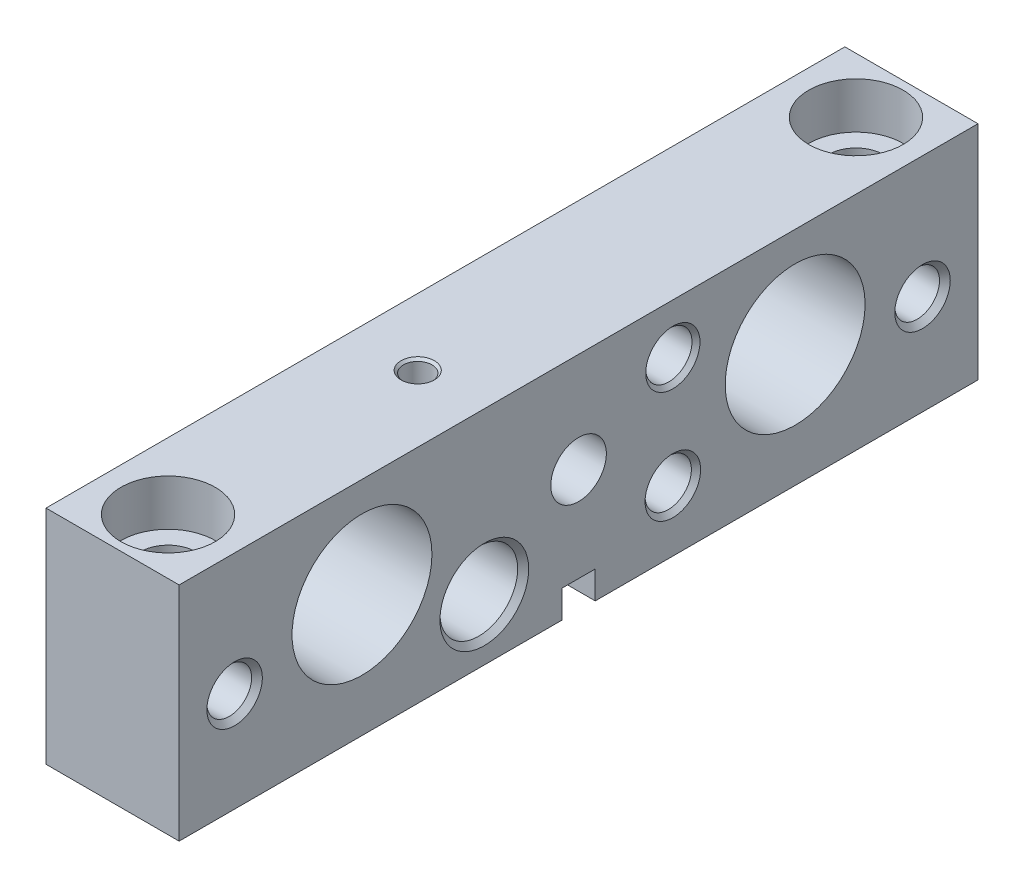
ISO-10303-21;
HEADER;
FILE_DESCRIPTION(('STEP AP214'),'2;1');
FILE_NAME('part.step','',(''),(''),'','','');
FILE_SCHEMA(('AUTOMOTIVE_DESIGN { 1 0 10303 214 1 1 1 1 }'));
ENDSEC;
DATA;
#1=APPLICATION_CONTEXT('core data for automotive mechanical design processes');
#2=APPLICATION_PROTOCOL_DEFINITION('international standard','automotive_design',2000,#1);
#3=PRODUCT_CONTEXT('',#1,'mechanical');
#4=PRODUCT('Part','Part','',(#3));
#5=PRODUCT_RELATED_PRODUCT_CATEGORY('part','',(#4));
#6=PRODUCT_DEFINITION_FORMATION('','',#4);
#7=PRODUCT_DEFINITION_CONTEXT('part definition',#1,'design');
#8=PRODUCT_DEFINITION('design','',#6,#7);
#9=PRODUCT_DEFINITION_SHAPE('','',#8);
#10=(LENGTH_UNIT() NAMED_UNIT(*) SI_UNIT(.MILLI.,.METRE.));
#11=(NAMED_UNIT(*) PLANE_ANGLE_UNIT() SI_UNIT($,.RADIAN.));
#12=(NAMED_UNIT(*) SI_UNIT($,.STERADIAN.) SOLID_ANGLE_UNIT());
#13=UNCERTAINTY_MEASURE_WITH_UNIT(LENGTH_MEASURE(1.E-05),#10,'distance_accuracy_value','');
#14=(GEOMETRIC_REPRESENTATION_CONTEXT(3) GLOBAL_UNCERTAINTY_ASSIGNED_CONTEXT((#13)) GLOBAL_UNIT_ASSIGNED_CONTEXT((#10,
#11,#12)) REPRESENTATION_CONTEXT('',''));
#15=CARTESIAN_POINT('',(0.,0.,0.));
#16=DIRECTION('',(0.,0.,1.));
#17=DIRECTION('',(1.,0.,0.));
#18=AXIS2_PLACEMENT_3D('',#15,#16,#17);
#19=CARTESIAN_POINT('',(19.05,-17.4498,57.15));
#20=DIRECTION('',(1.,0.,0.));
#21=DIRECTION('',(0.,0.,-1.));
#22=AXIS2_PLACEMENT_3D('',#19,#20,#21);
#23=PLANE('',#22);
#24=CARTESIAN_POINT('',(19.05,-3.1496,-49.2125));
#25=DIRECTION('',(1.,0.,0.));
#26=DIRECTION('',(0.,0.,-1.));
#27=AXIS2_PLACEMENT_3D('',#24,#25,#26);
#28=CIRCLE('',#27,3.96875);
#29=CARTESIAN_POINT('',(19.05,-3.1496,-53.18125));
#30=VERTEX_POINT('',#29);
#31=EDGE_CURVE('E216',#30,#30,#28,.T.);
#32=ORIENTED_EDGE('',*,*,#31,.F.);
#33=EDGE_LOOP('',(#32));
#34=FACE_BOUND('',#33,.T.);
#35=CARTESIAN_POINT('',(19.05,0.0253999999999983,-30.988));
#36=DIRECTION('',(1.,0.,0.));
#37=DIRECTION('',(0.,0.,-1.));
#38=AXIS2_PLACEMENT_3D('',#35,#36,#37);
#39=CIRCLE('',#38,10.0076);
#40=CARTESIAN_POINT('',(19.05,0.0253999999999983,-40.9956));
#41=VERTEX_POINT('',#40);
#42=EDGE_CURVE('E796',#41,#41,#39,.T.);
#43=ORIENTED_EDGE('',*,*,#42,.F.);
#44=EDGE_LOOP('',(#43));
#45=FACE_BOUND('',#44,.T.);
#46=CARTESIAN_POINT('',(19.05,7.1628,-13.4874));
#47=DIRECTION('',(1.,0.,0.));
#48=DIRECTION('',(0.,0.,-1.));
#49=AXIS2_PLACEMENT_3D('',#46,#47,#48);
#50=CIRCLE('',#49,3.88);
#51=CARTESIAN_POINT('',(19.05,7.1628,-17.3674));
#52=VERTEX_POINT('',#51);
#53=EDGE_CURVE('E343',#52,#52,#50,.T.);
#54=ORIENTED_EDGE('',*,*,#53,.F.);
#55=EDGE_LOOP('',(#54));
#56=FACE_BOUND('',#55,.T.);
#57=CARTESIAN_POINT('',(19.05,-8.7122,-13.4874));
#58=DIRECTION('',(1.,0.,0.));
#59=DIRECTION('',(0.,0.,-1.));
#60=AXIS2_PLACEMENT_3D('',#57,#58,#59);
#61=CIRCLE('',#60,3.9751);
#62=CARTESIAN_POINT('',(19.05,-8.7122,-17.4625));
#63=VERTEX_POINT('',#62);
#64=EDGE_CURVE('E366',#63,#63,#61,.T.);
#65=ORIENTED_EDGE('',*,*,#64,.F.);
#66=EDGE_LOOP('',(#65));
#67=FACE_BOUND('',#66,.T.);
#68=DIRECTION('',(0.,-1.,0.));
#69=VECTOR('',#68,1.);
#70=CARTESIAN_POINT('',(19.05,14.3002,57.15));
#71=LINE('',#70,#69);
#72=CARTESIAN_POINT('',(19.05,14.3002,57.15));
#73=VERTEX_POINT('',#72);
#74=CARTESIAN_POINT('',(19.05,-17.4498,57.15));
#75=VERTEX_POINT('',#74);
#76=EDGE_CURVE('E375',#73,#75,#71,.T.);
#77=ORIENTED_EDGE('',*,*,#76,.T.);
#78=DIRECTION('',(0.,0.,-1.));
#79=VECTOR('',#78,1.);
#80=CARTESIAN_POINT('',(19.05,-17.4498,57.15));
#81=LINE('',#80,#79);
#82=CARTESIAN_POINT('',(19.05,-17.4498,2.38379));
#83=VERTEX_POINT('',#82);
#84=EDGE_CURVE('E378',#75,#83,#81,.T.);
#85=ORIENTED_EDGE('',*,*,#84,.T.);
#86=DIRECTION('',(0.,1.,0.));
#87=VECTOR('',#86,1.);
#88=CARTESIAN_POINT('',(19.05,-17.4498,2.38379));
#89=LINE('',#88,#87);
#90=CARTESIAN_POINT('',(19.05,-13.4874,2.38379));
#91=VERTEX_POINT('',#90);
#92=EDGE_CURVE('E381',#83,#91,#89,.T.);
#93=ORIENTED_EDGE('',*,*,#92,.T.);
#94=DIRECTION('',(0.,0.,-1.));
#95=VECTOR('',#94,1.);
#96=CARTESIAN_POINT('',(19.05,-13.4874,2.38379));
#97=LINE('',#96,#95);
#98=CARTESIAN_POINT('',(19.05,-13.4874,-2.38379));
#99=VERTEX_POINT('',#98);
#100=EDGE_CURVE('E383',#91,#99,#97,.T.);
#101=ORIENTED_EDGE('',*,*,#100,.T.);
#102=DIRECTION('',(0.,-1.,0.));
#103=VECTOR('',#102,1.);
#104=CARTESIAN_POINT('',(19.05,-13.4874,-2.38379));
#105=LINE('',#104,#103);
#106=CARTESIAN_POINT('',(19.05,-17.4498,-2.38379));
#107=VERTEX_POINT('',#106);
#108=EDGE_CURVE('E385',#99,#107,#105,.T.);
#109=ORIENTED_EDGE('',*,*,#108,.T.);
#110=DIRECTION('',(0.,0.,-1.));
#111=VECTOR('',#110,1.);
#112=CARTESIAN_POINT('',(19.05,-17.4498,-2.38379));
#113=LINE('',#112,#111);
#114=CARTESIAN_POINT('',(19.05,-17.4498,-57.15));
#115=VERTEX_POINT('',#114);
#116=EDGE_CURVE('E387',#107,#115,#113,.T.);
#117=ORIENTED_EDGE('',*,*,#116,.T.);
#118=DIRECTION('',(0.,1.,0.));
#119=VECTOR('',#118,1.);
#120=CARTESIAN_POINT('',(19.05,-17.4498,-57.15));
#121=LINE('',#120,#119);
#122=CARTESIAN_POINT('',(19.05,14.3002,-57.15));
#123=VERTEX_POINT('',#122);
#124=EDGE_CURVE('E389',#115,#123,#121,.T.);
#125=ORIENTED_EDGE('',*,*,#124,.T.);
#126=DIRECTION('',(0.,0.,1.));
#127=VECTOR('',#126,1.);
#128=CARTESIAN_POINT('',(19.05,14.3002,-57.15));
#129=LINE('',#128,#127);
#130=EDGE_CURVE('E391',#123,#73,#129,.T.);
#131=ORIENTED_EDGE('',*,*,#130,.T.);
#132=EDGE_LOOP('',(#77,#85,#93,#101,#109,#117,#125,#131));
#133=FACE_BOUND('',#132,.T.);
#134=CARTESIAN_POINT('',(19.05,-8.7122,13.4874));
#135=DIRECTION('',(1.,0.,0.));
#136=DIRECTION('',(0.,0.,-1.));
#137=AXIS2_PLACEMENT_3D('',#134,#135,#136);
#138=CIRCLE('',#137,6.35);
#139=CARTESIAN_POINT('',(19.05,-8.7122,7.1374));
#140=VERTEX_POINT('',#139);
#141=EDGE_CURVE('E354',#140,#140,#138,.T.);
#142=ORIENTED_EDGE('',*,*,#141,.F.);
#143=EDGE_LOOP('',(#142));
#144=FACE_BOUND('',#143,.T.);
#145=CARTESIAN_POINT('',(19.05,0.0253999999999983,30.988));
#146=DIRECTION('',(1.,0.,0.));
#147=DIRECTION('',(0.,0.,-1.));
#148=AXIS2_PLACEMENT_3D('',#145,#146,#147);
#149=CIRCLE('',#148,10.0076);
#150=CARTESIAN_POINT('',(19.05,0.0253999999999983,20.9804));
#151=VERTEX_POINT('',#150);
#152=EDGE_CURVE('E802',#151,#151,#149,.T.);
#153=ORIENTED_EDGE('',*,*,#152,.F.);
#154=EDGE_LOOP('',(#153));
#155=FACE_BOUND('',#154,.T.);
#156=CARTESIAN_POINT('',(19.05,0.0253999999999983,0.));
#157=DIRECTION('',(-1.,0.,0.));
#158=DIRECTION('',(0.,0.,1.));
#159=AXIS2_PLACEMENT_3D('',#156,#157,#158);
#160=CIRCLE('',#159,3.9751);
#161=CARTESIAN_POINT('',(19.05,0.0253999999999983,3.9751));
#162=VERTEX_POINT('',#161);
#163=EDGE_CURVE('E775',#162,#162,#160,.T.);
#164=ORIENTED_EDGE('',*,*,#163,.T.);
#165=EDGE_LOOP('',(#164));
#166=FACE_BOUND('',#165,.T.);
#167=CARTESIAN_POINT('',(19.05,-3.1496,49.2125));
#168=DIRECTION('',(1.,0.,0.));
#169=DIRECTION('',(0.,0.,-1.));
#170=AXIS2_PLACEMENT_3D('',#167,#168,#169);
#171=CIRCLE('',#170,3.96875);
#172=CARTESIAN_POINT('',(19.05,-3.1496,45.24375));
#173=VERTEX_POINT('',#172);
#174=EDGE_CURVE('E180',#173,#173,#171,.T.);
#175=ORIENTED_EDGE('',*,*,#174,.F.);
#176=EDGE_LOOP('',(#175));
#177=FACE_BOUND('',#176,.T.);
#178=ADVANCED_FACE('F33',(#34,#45,#56,#67,#133,#144,#155,#166,#177),#23,.T.);
#179=CARTESIAN_POINT('',(0.,-17.4498,57.15));
#180=DIRECTION('',(1.,0.,0.));
#181=DIRECTION('',(0.,0.,-1.));
#182=AXIS2_PLACEMENT_3D('',#179,#180,#181);
#183=PLANE('',#182);
#184=CARTESIAN_POINT('',(0.,-3.1496,-49.2125));
#185=DIRECTION('',(1.,0.,0.));
#186=DIRECTION('',(0.,0.,-1.));
#187=AXIS2_PLACEMENT_3D('',#184,#185,#186);
#188=CIRCLE('',#187,3.96875);
#189=CARTESIAN_POINT('',(0.,-3.1496,-53.18125));
#190=VERTEX_POINT('',#189);
#191=EDGE_CURVE('E764',#190,#190,#188,.T.);
#192=ORIENTED_EDGE('',*,*,#191,.T.);
#193=EDGE_LOOP('',(#192));
#194=FACE_BOUND('',#193,.T.);
#195=CARTESIAN_POINT('',(0.,0.0253999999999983,-30.988));
#196=DIRECTION('',(1.,0.,0.));
#197=DIRECTION('',(0.,0.,-1.));
#198=AXIS2_PLACEMENT_3D('',#195,#196,#197);
#199=CIRCLE('',#198,10.0076);
#200=CARTESIAN_POINT('',(0.,0.0253999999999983,-40.9956));
#201=VERTEX_POINT('',#200);
#202=EDGE_CURVE('E793',#201,#201,#199,.T.);
#203=ORIENTED_EDGE('',*,*,#202,.T.);
#204=EDGE_LOOP('',(#203));
#205=FACE_BOUND('',#204,.T.);
#206=CARTESIAN_POINT('',(0.,7.1628,-13.4874));
#207=DIRECTION('',(1.,0.,0.));
#208=DIRECTION('',(0.,0.,-1.));
#209=AXIS2_PLACEMENT_3D('',#206,#207,#208);
#210=CIRCLE('',#209,3.88);
#211=CARTESIAN_POINT('',(0.,7.1628,-17.3674));
#212=VERTEX_POINT('',#211);
#213=EDGE_CURVE('E334',#212,#212,#210,.T.);
#214=ORIENTED_EDGE('',*,*,#213,.T.);
#215=EDGE_LOOP('',(#214));
#216=FACE_BOUND('',#215,.T.);
#217=CARTESIAN_POINT('',(0.,-8.7122,-13.4874));
#218=DIRECTION('',(1.,0.,0.));
#219=DIRECTION('',(0.,0.,-1.));
#220=AXIS2_PLACEMENT_3D('',#217,#218,#219);
#221=CIRCLE('',#220,3.9751);
#222=CARTESIAN_POINT('',(0.,-8.7122,-17.4625));
#223=VERTEX_POINT('',#222);
#224=EDGE_CURVE('E357',#223,#223,#221,.T.);
#225=ORIENTED_EDGE('',*,*,#224,.T.);
#226=EDGE_LOOP('',(#225));
#227=FACE_BOUND('',#226,.T.);
#228=DIRECTION('',(0.,-1.,0.));
#229=VECTOR('',#228,1.);
#230=CARTESIAN_POINT('',(0.,14.3002,57.15));
#231=LINE('',#230,#229);
#232=CARTESIAN_POINT('',(0.,14.3002,57.15));
#233=VERTEX_POINT('',#232);
#234=CARTESIAN_POINT('',(0.,-17.4498,57.15));
#235=VERTEX_POINT('',#234);
#236=EDGE_CURVE('E372',#233,#235,#231,.T.);
#237=ORIENTED_EDGE('',*,*,#236,.F.);
#238=DIRECTION('',(0.,0.,1.));
#239=VECTOR('',#238,1.);
#240=CARTESIAN_POINT('',(0.,14.3002,-57.15));
#241=LINE('',#240,#239);
#242=CARTESIAN_POINT('',(0.,14.3002,-57.15));
#243=VERTEX_POINT('',#242);
#244=EDGE_CURVE('E379',#243,#233,#241,.T.);
#245=ORIENTED_EDGE('',*,*,#244,.F.);
#246=DIRECTION('',(0.,1.,0.));
#247=VECTOR('',#246,1.);
#248=CARTESIAN_POINT('',(0.,-17.4498,-57.15));
#249=LINE('',#248,#247);
#250=CARTESIAN_POINT('',(0.,-17.4498,-57.15));
#251=VERTEX_POINT('',#250);
#252=EDGE_CURVE('E407',#251,#243,#249,.T.);
#253=ORIENTED_EDGE('',*,*,#252,.F.);
#254=DIRECTION('',(0.,0.,-1.));
#255=VECTOR('',#254,1.);
#256=CARTESIAN_POINT('',(0.,-17.4498,-2.38379));
#257=LINE('',#256,#255);
#258=CARTESIAN_POINT('',(0.,-17.4498,-2.38379));
#259=VERTEX_POINT('',#258);
#260=EDGE_CURVE('E405',#259,#251,#257,.T.);
#261=ORIENTED_EDGE('',*,*,#260,.F.);
#262=DIRECTION('',(0.,-1.,0.));
#263=VECTOR('',#262,1.);
#264=CARTESIAN_POINT('',(0.,-13.4874,-2.38379));
#265=LINE('',#264,#263);
#266=CARTESIAN_POINT('',(0.,-13.4874,-2.38379));
#267=VERTEX_POINT('',#266);
#268=EDGE_CURVE('E403',#267,#259,#265,.T.);
#269=ORIENTED_EDGE('',*,*,#268,.F.);
#270=DIRECTION('',(0.,0.,-1.));
#271=VECTOR('',#270,1.);
#272=CARTESIAN_POINT('',(0.,-13.4874,2.38379));
#273=LINE('',#272,#271);
#274=CARTESIAN_POINT('',(0.,-13.4874,2.38379));
#275=VERTEX_POINT('',#274);
#276=EDGE_CURVE('E400',#275,#267,#273,.T.);
#277=ORIENTED_EDGE('',*,*,#276,.F.);
#278=DIRECTION('',(0.,1.,0.));
#279=VECTOR('',#278,1.);
#280=CARTESIAN_POINT('',(0.,-17.4498,2.38379));
#281=LINE('',#280,#279);
#282=CARTESIAN_POINT('',(0.,-17.4498,2.38379));
#283=VERTEX_POINT('',#282);
#284=EDGE_CURVE('E397',#283,#275,#281,.T.);
#285=ORIENTED_EDGE('',*,*,#284,.F.);
#286=DIRECTION('',(0.,0.,-1.));
#287=VECTOR('',#286,1.);
#288=CARTESIAN_POINT('',(0.,-17.4498,57.15));
#289=LINE('',#288,#287);
#290=EDGE_CURVE('E301',#235,#283,#289,.T.);
#291=ORIENTED_EDGE('',*,*,#290,.F.);
#292=EDGE_LOOP('',(#237,#245,#253,#261,#269,#277,#285,#291));
#293=FACE_BOUND('',#292,.T.);
#294=CARTESIAN_POINT('',(0.,-8.7122,13.4874));
#295=DIRECTION('',(1.,0.,0.));
#296=DIRECTION('',(0.,0.,-1.));
#297=AXIS2_PLACEMENT_3D('',#294,#295,#296);
#298=CIRCLE('',#297,6.35);
#299=CARTESIAN_POINT('',(0.,-8.7122,7.1374));
#300=VERTEX_POINT('',#299);
#301=EDGE_CURVE('E346',#300,#300,#298,.T.);
#302=ORIENTED_EDGE('',*,*,#301,.T.);
#303=EDGE_LOOP('',(#302));
#304=FACE_BOUND('',#303,.T.);
#305=CARTESIAN_POINT('',(0.,0.0253999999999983,30.988));
#306=DIRECTION('',(1.,0.,0.));
#307=DIRECTION('',(0.,0.,-1.));
#308=AXIS2_PLACEMENT_3D('',#305,#306,#307);
#309=CIRCLE('',#308,10.0076);
#310=CARTESIAN_POINT('',(0.,0.0253999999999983,20.9804));
#311=VERTEX_POINT('',#310);
#312=EDGE_CURVE('E799',#311,#311,#309,.T.);
#313=ORIENTED_EDGE('',*,*,#312,.T.);
#314=EDGE_LOOP('',(#313));
#315=FACE_BOUND('',#314,.T.);
#316=CARTESIAN_POINT('',(0.,0.0253999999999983,0.));
#317=DIRECTION('',(-1.,0.,0.));
#318=DIRECTION('',(0.,0.,1.));
#319=AXIS2_PLACEMENT_3D('',#316,#317,#318);
#320=CIRCLE('',#319,2.413);
#321=CARTESIAN_POINT('',(0.,0.0253999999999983,2.413));
#322=VERTEX_POINT('',#321);
#323=EDGE_CURVE('E790',#322,#322,#320,.T.);
#324=ORIENTED_EDGE('',*,*,#323,.F.);
#325=EDGE_LOOP('',(#324));
#326=FACE_BOUND('',#325,.T.);
#327=CARTESIAN_POINT('',(0.,-3.1496,49.2125));
#328=DIRECTION('',(1.,0.,0.));
#329=DIRECTION('',(0.,0.,-1.));
#330=AXIS2_PLACEMENT_3D('',#327,#328,#329);
#331=CIRCLE('',#330,3.96875);
#332=CARTESIAN_POINT('',(0.,-3.1496,45.24375));
#333=VERTEX_POINT('',#332);
#334=EDGE_CURVE('E754',#333,#333,#331,.T.);
#335=ORIENTED_EDGE('',*,*,#334,.T.);
#336=EDGE_LOOP('',(#335));
#337=FACE_BOUND('',#336,.T.);
#338=ADVANCED_FACE('F170',(#194,#205,#216,#227,#293,#304,#315,#326,#337),#183,.F.);
#339=CARTESIAN_POINT('',(9.525,-17.4498,49.2125));
#340=DIRECTION('',(0.,1.,0.));
#341=DIRECTION('',(0.,0.,1.));
#342=AXIS2_PLACEMENT_3D('',#339,#340,#341);
#343=CYLINDRICAL_SURFACE('',#342,3.96875);
#344=CARTESIAN_POINT('',(11.8720015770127,-3.1496,46.0121));
#345=CARTESIAN_POINT('',(11.872002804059,-3.09014218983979,46.0121004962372));
#346=CARTESIAN_POINT('',(11.8742741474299,-3.03066685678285,46.0137622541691));
#347=CARTESIAN_POINT('',(11.8832331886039,-2.912219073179,46.0203629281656));
#348=CARTESIAN_POINT('',(11.8899236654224,-2.85324696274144,46.0253039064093));
#349=CARTESIAN_POINT('',(11.9162136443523,-2.67752371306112,46.0449175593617));
#350=CARTESIAN_POINT('',(11.9420298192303,-2.56219348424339,46.0643803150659));
#351=CARTESIAN_POINT('',(12.0174690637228,-2.29788465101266,46.1235614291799));
#352=CARTESIAN_POINT('',(12.0722949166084,-2.15153807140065,46.1680234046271));
#353=CARTESIAN_POINT('',(12.1946694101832,-1.87103029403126,46.2747370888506));
#354=CARTESIAN_POINT('',(12.2622554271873,-1.73690665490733,46.3370413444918));
#355=CARTESIAN_POINT('',(12.3809692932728,-1.52063835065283,46.455847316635));
#356=CARTESIAN_POINT('',(12.4306639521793,-1.43531887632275,46.5081085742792));
#357=CARTESIAN_POINT('',(12.5309873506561,-1.27028188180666,46.6200730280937));
#358=CARTESIAN_POINT('',(12.581616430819,-1.1905664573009,46.6797789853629));
#359=CARTESIAN_POINT('',(12.7326084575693,-0.960103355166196,46.8697906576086));
#360=CARTESIAN_POINT('',(12.8322752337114,-0.817697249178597,47.0111785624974));
#361=CARTESIAN_POINT('',(13.0008678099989,-0.584795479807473,47.29142460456));
#362=CARTESIAN_POINT('',(13.0719528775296,-0.489615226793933,47.4251198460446));
#363=CARTESIAN_POINT('',(13.2016628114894,-0.318960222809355,47.7100043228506));
#364=CARTESIAN_POINT('',(13.260307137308,-0.243454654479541,47.861165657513));
#365=CARTESIAN_POINT('',(13.3521000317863,-0.126463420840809,48.1524779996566));
#366=CARTESIAN_POINT('',(13.3878513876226,-0.0814310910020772,48.2903765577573));
#367=CARTESIAN_POINT('',(13.4446930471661,-0.0101661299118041,48.5738837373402));
#368=CARTESIAN_POINT('',(13.4657914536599,0.0160768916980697,48.7194880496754));
#369=CARTESIAN_POINT('',(13.4916106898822,0.0481610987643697,49.0149340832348));
#370=CARTESIAN_POINT('',(13.4962726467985,0.0539289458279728,49.1647891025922));
#371=CARTESIAN_POINT('',(13.4886264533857,0.0444454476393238,49.4633919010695));
#372=CARTESIAN_POINT('',(13.4763177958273,0.029193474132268,49.6121396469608));
#373=CARTESIAN_POINT('',(13.4369950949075,-0.0198258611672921,49.8955802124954));
#374=CARTESIAN_POINT('',(13.4108564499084,-0.0524918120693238,50.0305913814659));
#375=CARTESIAN_POINT('',(13.3463405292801,-0.133834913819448,50.292571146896));
#376=CARTESIAN_POINT('',(13.307960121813,-0.182516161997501,50.4195376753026));
#377=CARTESIAN_POINT('',(13.2171685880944,-0.299133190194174,50.6750143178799));
#378=CARTESIAN_POINT('',(13.1637741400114,-0.368454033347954,50.8025359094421));
#379=CARTESIAN_POINT('',(13.0482693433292,-0.521383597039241,51.0443114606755));
#380=CARTESIAN_POINT('',(12.9861544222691,-0.604999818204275,51.1585584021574));
#381=CARTESIAN_POINT('',(12.8429048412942,-0.803171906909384,51.3954763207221));
#382=CARTESIAN_POINT('',(12.7604924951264,-0.920550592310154,51.515008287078));
#383=CARTESIAN_POINT('',(12.5930194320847,-1.17144164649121,51.7338536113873));
#384=CARTESIAN_POINT('',(12.5079553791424,-1.30497500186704,51.8331402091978));
#385=CARTESIAN_POINT('',(12.3484029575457,-1.57659364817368,52.0039020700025));
#386=CARTESIAN_POINT('',(12.2736070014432,-1.71351348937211,52.0769415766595));
#387=CARTESIAN_POINT('',(12.1349074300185,-2.00111469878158,52.2038444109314));
#388=CARTESIAN_POINT('',(12.0709802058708,-2.15176511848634,52.2577495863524));
#389=CARTESIAN_POINT('',(11.9817811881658,-2.41646589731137,52.329775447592));
#390=CARTESIAN_POINT('',(11.9506826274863,-2.52688916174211,52.3538252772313));
#391=CARTESIAN_POINT('',(11.9028077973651,-2.7525780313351,52.3902241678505));
#392=CARTESIAN_POINT('',(11.88599816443,-2.86783169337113,52.4026004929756));
#393=CARTESIAN_POINT('',(11.869612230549,-3.10106019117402,52.4146712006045));
#394=CARTESIAN_POINT('',(11.8701493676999,-3.21904789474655,52.4142821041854));
#395=CARTESIAN_POINT('',(11.8886340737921,-3.45294705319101,52.4006525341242));
#396=CARTESIAN_POINT('',(11.9066049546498,-3.56885551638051,52.3873948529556));
#397=CARTESIAN_POINT('',(11.9626588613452,-3.8222929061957,52.3446364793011));
#398=CARTESIAN_POINT('',(12.0045014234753,-3.95842861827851,52.312028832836));
#399=CARTESIAN_POINT('',(12.1020461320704,-4.22093317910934,52.2314050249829));
#400=CARTESIAN_POINT('',(12.1577902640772,-4.34727089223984,52.1833420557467));
#401=CARTESIAN_POINT('',(12.2613813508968,-4.55867271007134,52.0877094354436));
#402=CARTESIAN_POINT('',(12.3075653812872,-4.6459874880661,52.0431999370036));
#403=CARTESIAN_POINT('',(12.4021753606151,-4.81533199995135,51.9469811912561));
#404=CARTESIAN_POINT('',(12.4506022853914,-4.89735939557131,51.8952687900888));
#405=CARTESIAN_POINT('',(12.5481849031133,-5.05620831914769,51.7848084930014));
#406=CARTESIAN_POINT('',(12.5973412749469,-5.1330245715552,51.7260536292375));
#407=CARTESIAN_POINT('',(12.6950563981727,-5.28125296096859,51.6016372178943));
#408=CARTESIAN_POINT('',(12.7436151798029,-5.3526653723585,51.5359760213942));
#409=CARTESIAN_POINT('',(12.8398469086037,-5.49103261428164,51.3965489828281));
#410=CARTESIAN_POINT('',(12.8874883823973,-5.557884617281,51.3226589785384));
#411=CARTESIAN_POINT('',(12.979823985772,-5.68520881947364,51.1678247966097));
#412=CARTESIAN_POINT('',(13.024517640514,-5.74567999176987,51.0868794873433));
#413=CARTESIAN_POINT('',(13.1096891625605,-5.85939603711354,50.9183328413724));
#414=CARTESIAN_POINT('',(13.1501781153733,-5.91266003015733,50.8307501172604));
#415=CARTESIAN_POINT('',(13.2258986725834,-6.01128311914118,50.6491647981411));
#416=CARTESIAN_POINT('',(13.2611331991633,-6.056646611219,50.5551658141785));
#417=CARTESIAN_POINT('',(13.3367217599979,-6.15326712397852,50.326479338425));
#418=CARTESIAN_POINT('',(13.3743889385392,-6.20081498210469,50.1892777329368));
#419=CARTESIAN_POINT('',(13.4352259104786,-6.27721637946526,49.9067350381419));
#420=CARTESIAN_POINT('',(13.4584068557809,-6.30608429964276,49.7614003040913));
#421=CARTESIAN_POINT('',(13.4884514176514,-6.34344679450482,49.4658065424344));
#422=CARTESIAN_POINT('',(13.4952482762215,-6.35185801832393,49.3155298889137));
#423=CARTESIAN_POINT('',(13.4916953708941,-6.34745204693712,49.0154924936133));
#424=CARTESIAN_POINT('',(13.4813454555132,-6.3346346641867,48.8657317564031));
#425=CARTESIAN_POINT('',(13.4455856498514,-6.29009925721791,48.5805240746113));
#426=CARTESIAN_POINT('',(13.4211358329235,-6.25958550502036,48.444761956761));
#427=CARTESIAN_POINT('',(13.3597428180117,-6.18231903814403,48.1809544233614));
#428=CARTESIAN_POINT('',(13.3227963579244,-6.13556208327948,48.0529110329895));
#429=CARTESIAN_POINT('',(13.2351040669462,-6.02323791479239,47.7961501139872));
#430=CARTESIAN_POINT('',(13.1834524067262,-5.95640990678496,47.6682998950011));
#431=CARTESIAN_POINT('',(13.0712107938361,-5.80845622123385,47.4255239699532));
#432=CARTESIAN_POINT('',(13.0106168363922,-5.72732413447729,47.310604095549));
#433=CARTESIAN_POINT('',(12.8706661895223,-5.53503230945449,47.0723522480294));
#434=CARTESIAN_POINT('',(12.7899936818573,-5.42111835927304,46.9520220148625));
#435=CARTESIAN_POINT('',(12.6253665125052,-5.17740076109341,46.7310273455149));
#436=CARTESIAN_POINT('',(12.5414072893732,-5.04757445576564,46.6303914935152));
#437=CARTESIAN_POINT('',(12.3790839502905,-4.77710557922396,46.452206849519));
#438=CARTESIAN_POINT('',(12.3006268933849,-4.63693276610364,46.3740304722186));
#439=CARTESIAN_POINT('',(12.1543385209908,-4.34181675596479,46.2380309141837));
#440=CARTESIAN_POINT('',(12.0864871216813,-4.18690239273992,46.1801689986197));
#441=CARTESIAN_POINT('',(11.9915104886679,-3.9149546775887,46.1028717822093));
#442=CARTESIAN_POINT('',(11.9583120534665,-3.80189676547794,46.0770605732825));
#443=CARTESIAN_POINT('',(11.90681604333,-3.57051997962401,46.0377534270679));
#444=CARTESIAN_POINT('',(11.8884608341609,-3.45222335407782,46.0242098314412));
#445=CARTESIAN_POINT('',(11.8767781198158,-3.30252700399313,46.015608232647));
#446=CARTESIAN_POINT('',(11.8749911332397,-3.27199093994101,46.0142944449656));
#447=CARTESIAN_POINT('',(11.8726024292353,-3.21083814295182,46.0125401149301));
#448=CARTESIAN_POINT('',(11.872000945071,-3.18022139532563,46.0120997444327));
#449=CARTESIAN_POINT('',(11.8720015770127,-3.1496,46.0121));
#450=B_SPLINE_CURVE_WITH_KNOTS('',3,(#344,#345,#346,#347,#348,#349,#350,#351,#352,#353,#354,
#355,#356,#357,#358,#359,#360,#361,#362,#363,#364,#365,#366,#367,#368,#369,#370,#371,#372,#373,
#374,#375,#376,#377,#378,#379,#380,#381,#382,#383,#384,#385,#386,#387,#388,#389,#390,#391,#392,
#393,#394,#395,#396,#397,#398,#399,#400,#401,#402,#403,#404,#405,#406,#407,#408,#409,#410,#411,
#412,#413,#414,#415,#416,#417,#418,#419,#420,#421,#422,#423,#424,#425,#426,#427,#428,#429,#430,
#431,#432,#433,#434,#435,#436,#437,#438,#439,#440,#441,#442,#443,#444,#445,#446,#447,#448,#449),
.UNSPECIFIED.,.T.,.F.,(4,2,2,2,2,2,2,2,2,2,2,2,2,2,2,2,2,2,2,2,2,2,2,2,2,2,2,2,2,2,2,2,2,2,2,2,
2,2,2,2,2,2,2,2,2,2,2,2,2,2,2,2,4),(0.,0.178335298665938,0.356782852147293,0.714351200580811,
1.19917222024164,1.68543602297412,2.02019289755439,2.35507429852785,3.02353847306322,
3.55814494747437,4.0919089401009,4.53823939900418,4.98432284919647,5.43200248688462,
5.87969550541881,6.30194783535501,6.72430827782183,7.1865921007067,7.64911922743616,
8.20723963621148,8.76609304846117,9.28140034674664,9.795573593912,10.1459662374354,
10.4955384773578,10.8473971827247,11.1997270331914,11.6356309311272,12.0728676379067,
12.397510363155,12.7222956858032,13.0474050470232,13.3724978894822,13.7034171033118,
14.0343894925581,14.3644658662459,14.6943579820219,15.1424144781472,15.5901256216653,
16.0396579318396,16.4891942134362,16.9112288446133,17.333373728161,17.7913908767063,
18.2496137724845,18.8005397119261,19.352259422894,19.8865934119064,20.4199029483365,
20.7805346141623,21.139759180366,21.231585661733,21.3234302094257),.UNSPECIFIED.);
#451=CARTESIAN_POINT('',(11.8720015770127,-3.1496,46.0121));
#452=VERTEX_POINT('',#451);
#453=EDGE_CURVE('E175',#452,#452,#450,.T.);
#454=ORIENTED_EDGE('',*,*,#453,.T.);
#455=EDGE_LOOP('',(#454));
#456=FACE_BOUND('',#455,.T.);
#457=CARTESIAN_POINT('',(9.525,7.6962,49.2125));
#458=DIRECTION('',(0.,1.,0.));
#459=DIRECTION('',(0.,0.,1.));
#460=AXIS2_PLACEMENT_3D('',#457,#458,#459);
#461=CIRCLE('',#460,3.96875);
#462=CARTESIAN_POINT('',(9.525,7.6962,53.18125));
#463=VERTEX_POINT('',#462);
#464=EDGE_CURVE('E307',#463,#463,#461,.T.);
#465=ORIENTED_EDGE('',*,*,#464,.T.);
#466=EDGE_LOOP('',(#465));
#467=FACE_BOUND('',#466,.T.);
#468=CARTESIAN_POINT('',(9.525,-17.4498,49.2125));
#469=DIRECTION('',(0.,1.,0.));
#470=DIRECTION('',(0.,0.,1.));
#471=AXIS2_PLACEMENT_3D('',#468,#469,#470);
#472=CIRCLE('',#471,3.96875);
#473=CARTESIAN_POINT('',(9.525,-17.4498,53.18125));
#474=VERTEX_POINT('',#473);
#475=EDGE_CURVE('E305',#474,#474,#472,.T.);
#476=ORIENTED_EDGE('',*,*,#475,.F.);
#477=EDGE_LOOP('',(#476));
#478=FACE_BOUND('',#477,.T.);
#479=CARTESIAN_POINT('',(7.17799842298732,-3.1496,46.0121));
#480=CARTESIAN_POINT('',(7.17799719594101,-3.20905781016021,46.0121004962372));
#481=CARTESIAN_POINT('',(7.17572585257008,-3.26853314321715,46.0137622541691));
#482=CARTESIAN_POINT('',(7.16676681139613,-3.386980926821,46.0203629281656));
#483=CARTESIAN_POINT('',(7.1600763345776,-3.44595303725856,46.0253039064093));
#484=CARTESIAN_POINT('',(7.13378635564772,-3.62167628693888,46.0449175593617));
#485=CARTESIAN_POINT('',(7.10797018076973,-3.73700651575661,46.0643803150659));
#486=CARTESIAN_POINT('',(7.03253093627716,-4.00131534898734,46.1235614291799));
#487=CARTESIAN_POINT('',(6.97770508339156,-4.14766192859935,46.1680234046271));
#488=CARTESIAN_POINT('',(6.85533058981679,-4.42816970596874,46.2747370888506));
#489=CARTESIAN_POINT('',(6.78774457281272,-4.56229334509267,46.3370413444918));
#490=CARTESIAN_POINT('',(6.66903070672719,-4.77856164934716,46.455847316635));
#491=CARTESIAN_POINT('',(6.61933604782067,-4.86388112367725,46.5081085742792));
#492=CARTESIAN_POINT('',(6.51901264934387,-5.02891811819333,46.6200730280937));
#493=CARTESIAN_POINT('',(6.468383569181,-5.1086335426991,46.6797789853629));
#494=CARTESIAN_POINT('',(6.31739154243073,-5.3390966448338,46.8697906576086));
#495=CARTESIAN_POINT('',(6.21772476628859,-5.4815027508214,47.0111785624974));
#496=CARTESIAN_POINT('',(6.0491321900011,-5.71440452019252,47.29142460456));
#497=CARTESIAN_POINT('',(5.97804712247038,-5.80958477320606,47.4251198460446));
#498=CARTESIAN_POINT('',(5.84833718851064,-5.98023977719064,47.7100043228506));
#499=CARTESIAN_POINT('',(5.78969286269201,-6.05574534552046,47.861165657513));
#500=CARTESIAN_POINT('',(5.69789996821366,-6.17273657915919,48.1524779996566));
#501=CARTESIAN_POINT('',(5.66214861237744,-6.21776890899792,48.2903765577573));
#502=CARTESIAN_POINT('',(5.60530695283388,-6.2890338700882,48.5738837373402));
#503=CARTESIAN_POINT('',(5.5842085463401,-6.31527689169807,48.7194880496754));
#504=CARTESIAN_POINT('',(5.5583893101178,-6.34736109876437,49.0149340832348));
#505=CARTESIAN_POINT('',(5.55372735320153,-6.35312894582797,49.1647891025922));
#506=CARTESIAN_POINT('',(5.5613735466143,-6.34364544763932,49.4633919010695));
#507=CARTESIAN_POINT('',(5.57368220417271,-6.32839347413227,49.6121396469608));
#508=CARTESIAN_POINT('',(5.6130049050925,-6.27937413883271,49.8955802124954));
#509=CARTESIAN_POINT('',(5.63914355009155,-6.24670818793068,50.0305913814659));
#510=CARTESIAN_POINT('',(5.70365947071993,-6.16536508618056,50.2925711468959));
#511=CARTESIAN_POINT('',(5.74203987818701,-6.1166838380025,50.4195376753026));
#512=CARTESIAN_POINT('',(5.83283141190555,-6.00006680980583,50.6750143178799));
#513=CARTESIAN_POINT('',(5.88622585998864,-5.93074596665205,50.8025359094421));
#514=CARTESIAN_POINT('',(6.00173065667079,-5.77781640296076,51.0443114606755));
#515=CARTESIAN_POINT('',(6.06384557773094,-5.69420018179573,51.1585584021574));
#516=CARTESIAN_POINT('',(6.2070951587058,-5.49602809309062,51.3954763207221));
#517=CARTESIAN_POINT('',(6.28950750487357,-5.37864940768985,51.515008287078));
#518=CARTESIAN_POINT('',(6.45698056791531,-5.12775835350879,51.7338536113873));
#519=CARTESIAN_POINT('',(6.54204462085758,-4.99422499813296,51.8331402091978));
#520=CARTESIAN_POINT('',(6.70159704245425,-4.72260635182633,52.0039020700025));
#521=CARTESIAN_POINT('',(6.77639299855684,-4.58568651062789,52.0769415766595));
#522=CARTESIAN_POINT('',(6.91509256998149,-4.29808530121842,52.2038444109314));
#523=CARTESIAN_POINT('',(6.9790197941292,-4.14743488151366,52.2577495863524));
#524=CARTESIAN_POINT('',(7.06821881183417,-3.88273410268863,52.329775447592));
#525=CARTESIAN_POINT('',(7.09931737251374,-3.77231083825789,52.3538252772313));
#526=CARTESIAN_POINT('',(7.14719220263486,-3.5466219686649,52.3902241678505));
#527=CARTESIAN_POINT('',(7.16400183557,-3.43136830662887,52.4026004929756));
#528=CARTESIAN_POINT('',(7.18038776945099,-3.19813980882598,52.4146712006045));
#529=CARTESIAN_POINT('',(7.17985063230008,-3.08015210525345,52.4142821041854));
#530=CARTESIAN_POINT('',(7.16136592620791,-2.84625294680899,52.4006525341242));
#531=CARTESIAN_POINT('',(7.14339504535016,-2.73034448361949,52.3873948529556));
#532=CARTESIAN_POINT('',(7.08734113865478,-2.4769070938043,52.3446364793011));
#533=CARTESIAN_POINT('',(7.04549857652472,-2.34077138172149,52.312028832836));
#534=CARTESIAN_POINT('',(6.94795386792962,-2.07826682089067,52.2314050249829));
#535=CARTESIAN_POINT('',(6.8922097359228,-1.95192910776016,52.1833420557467));
#536=CARTESIAN_POINT('',(6.78861864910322,-1.74052728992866,52.0877094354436));
#537=CARTESIAN_POINT('',(6.74243461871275,-1.6532125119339,52.0431999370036));
#538=CARTESIAN_POINT('',(6.6478246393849,-1.48386800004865,51.9469811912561));
#539=CARTESIAN_POINT('',(6.59939771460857,-1.40184060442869,51.8952687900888));
#540=CARTESIAN_POINT('',(6.50181509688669,-1.24299168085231,51.7848084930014));
#541=CARTESIAN_POINT('',(6.45265872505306,-1.1661754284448,51.7260536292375));
#542=CARTESIAN_POINT('',(6.35494360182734,-1.01794703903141,51.6016372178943));
#543=CARTESIAN_POINT('',(6.30638482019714,-0.946534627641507,51.5359760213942));
#544=CARTESIAN_POINT('',(6.21015309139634,-0.808167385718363,51.3965489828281));
#545=CARTESIAN_POINT('',(6.16251161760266,-0.741315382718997,51.3226589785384));
#546=CARTESIAN_POINT('',(6.07017601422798,-0.613991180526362,51.1678247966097));
#547=CARTESIAN_POINT('',(6.02548235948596,-0.553520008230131,51.0868794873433));
#548=CARTESIAN_POINT('',(5.9403108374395,-0.439803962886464,50.9183328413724));
#549=CARTESIAN_POINT('',(5.89982188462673,-0.386539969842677,50.8307501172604));
#550=CARTESIAN_POINT('',(5.82410132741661,-0.287916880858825,50.6491647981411));
#551=CARTESIAN_POINT('',(5.78886680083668,-0.242553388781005,50.5551658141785));
#552=CARTESIAN_POINT('',(5.71327824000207,-0.145932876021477,50.326479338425));
#553=CARTESIAN_POINT('',(5.67561106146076,-0.0983850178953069,50.1892777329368));
#554=CARTESIAN_POINT('',(5.61477408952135,-0.0219836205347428,49.9067350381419));
#555=CARTESIAN_POINT('',(5.59159314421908,0.0068842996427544,49.7614003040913));
#556=CARTESIAN_POINT('',(5.56154858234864,0.0442467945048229,49.4658065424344));
#557=CARTESIAN_POINT('',(5.55475172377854,0.0526580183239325,49.3155298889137));
#558=CARTESIAN_POINT('',(5.55830462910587,0.0482520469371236,49.0154924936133));
#559=CARTESIAN_POINT('',(5.56865454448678,0.0354346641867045,48.8657317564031));
#560=CARTESIAN_POINT('',(5.60441435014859,-0.00910074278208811,48.5805240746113));
#561=CARTESIAN_POINT('',(5.62886416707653,-0.0396144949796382,48.444761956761));
#562=CARTESIAN_POINT('',(5.69025718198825,-0.116880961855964,48.1809544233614));
#563=CARTESIAN_POINT('',(5.72720364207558,-0.163637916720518,48.0529110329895));
#564=CARTESIAN_POINT('',(5.81489593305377,-0.275962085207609,47.7961501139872));
#565=CARTESIAN_POINT('',(5.86654759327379,-0.342790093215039,47.6682998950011));
#566=CARTESIAN_POINT('',(5.97878920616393,-0.490743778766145,47.4255239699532));
#567=CARTESIAN_POINT('',(6.03938316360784,-0.571875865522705,47.310604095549));
#568=CARTESIAN_POINT('',(6.17933381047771,-0.764167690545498,47.0723522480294));
#569=CARTESIAN_POINT('',(6.26000631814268,-0.878081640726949,46.9520220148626));
#570=CARTESIAN_POINT('',(6.42463348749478,-1.12179923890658,46.7310273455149));
#571=CARTESIAN_POINT('',(6.50859271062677,-1.25162554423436,46.6303914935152));
#572=CARTESIAN_POINT('',(6.67091604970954,-1.52209442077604,46.452206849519));
#573=CARTESIAN_POINT('',(6.7493731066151,-1.66226723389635,46.3740304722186));
#574=CARTESIAN_POINT('',(6.89566147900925,-1.9573832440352,46.2380309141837));
#575=CARTESIAN_POINT('',(6.96351287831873,-2.11229760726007,46.1801689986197));
#576=CARTESIAN_POINT('',(7.05848951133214,-2.38424532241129,46.1028717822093));
#577=CARTESIAN_POINT('',(7.09168794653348,-2.49730323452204,46.0770605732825));
#578=CARTESIAN_POINT('',(7.14318395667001,-2.72868002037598,46.0377534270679));
#579=CARTESIAN_POINT('',(7.1615391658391,-2.84697664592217,46.0242098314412));
#580=CARTESIAN_POINT('',(7.17322188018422,-2.99667299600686,46.015608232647));
#581=CARTESIAN_POINT('',(7.17500886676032,-3.02720906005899,46.0142944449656));
#582=CARTESIAN_POINT('',(7.17739757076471,-3.08836185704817,46.0125401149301));
#583=CARTESIAN_POINT('',(7.17799905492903,-3.11897860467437,46.0120997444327));
#584=CARTESIAN_POINT('',(7.17799842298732,-3.1496,46.0121));
#585=B_SPLINE_CURVE_WITH_KNOTS('',3,(#479,#480,#481,#482,#483,#484,#485,#486,#487,#488,#489,
#490,#491,#492,#493,#494,#495,#496,#497,#498,#499,#500,#501,#502,#503,#504,#505,#506,#507,#508,
#509,#510,#511,#512,#513,#514,#515,#516,#517,#518,#519,#520,#521,#522,#523,#524,#525,#526,#527,
#528,#529,#530,#531,#532,#533,#534,#535,#536,#537,#538,#539,#540,#541,#542,#543,#544,#545,#546,
#547,#548,#549,#550,#551,#552,#553,#554,#555,#556,#557,#558,#559,#560,#561,#562,#563,#564,#565,
#566,#567,#568,#569,#570,#571,#572,#573,#574,#575,#576,#577,#578,#579,#580,#581,#582,#583,#584),
.UNSPECIFIED.,.T.,.F.,(4,2,2,2,2,2,2,2,2,2,2,2,2,2,2,2,2,2,2,2,2,2,2,2,2,2,2,2,2,2,2,2,2,2,2,2,
2,2,2,2,2,2,2,2,2,2,2,2,2,2,2,2,4),(0.,0.178335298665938,0.356782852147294,0.714351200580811,
1.19917222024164,1.68543602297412,2.02019289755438,2.35507429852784,3.02353847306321,
3.55814494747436,4.09190894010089,4.53823939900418,4.98432284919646,5.43200248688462,
5.8796955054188,6.30194783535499,6.72430827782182,7.18659210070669,7.64911922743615,
8.20723963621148,8.76609304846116,9.28140034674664,9.795573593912,10.1459662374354,
10.4955384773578,10.8473971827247,11.1997270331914,11.6356309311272,12.0728676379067,
12.397510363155,12.7222956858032,13.0474050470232,13.3724978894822,13.7034171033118,
14.034389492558,14.3644658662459,14.6943579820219,15.1424144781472,15.5901256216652,
16.0396579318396,16.4891942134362,16.9112288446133,17.333373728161,17.7913908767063,
18.2496137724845,18.8005397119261,19.352259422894,19.8865934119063,20.4199029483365,
20.7805346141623,21.139759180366,21.231585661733,21.3234302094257),.UNSPECIFIED.);
#586=CARTESIAN_POINT('',(7.17799842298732,-3.1496,46.0121));
#587=VERTEX_POINT('',#586);
#588=EDGE_CURVE('E37',#587,#587,#585,.T.);
#589=ORIENTED_EDGE('',*,*,#588,.T.);
#590=EDGE_LOOP('',(#589));
#591=FACE_BOUND('',#590,.T.);
#592=ADVANCED_FACE('F165',(#456,#467,#478,#591),#343,.F.);
#593=CARTESIAN_POINT('',(9.525,-17.4498,-49.2125));
#594=DIRECTION('',(0.,1.,0.));
#595=DIRECTION('',(0.,0.,1.));
#596=AXIS2_PLACEMENT_3D('',#593,#594,#595);
#597=CYLINDRICAL_SURFACE('',#596,3.96875);
#598=CARTESIAN_POINT('',(11.8720015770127,-3.1496,-52.4129));
#599=CARTESIAN_POINT('',(11.872002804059,-3.09014218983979,-52.4128995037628));
#600=CARTESIAN_POINT('',(11.8742741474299,-3.03066685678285,-52.4112377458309));
#601=CARTESIAN_POINT('',(11.8832331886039,-2.912219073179,-52.4046370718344));
#602=CARTESIAN_POINT('',(11.8899236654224,-2.85324696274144,-52.3996960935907));
#603=CARTESIAN_POINT('',(11.9162136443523,-2.67752371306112,-52.3800824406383));
#604=CARTESIAN_POINT('',(11.9420298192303,-2.56219348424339,-52.3606196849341));
#605=CARTESIAN_POINT('',(12.0174690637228,-2.29788465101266,-52.3014385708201));
#606=CARTESIAN_POINT('',(12.0722949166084,-2.15153807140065,-52.2569765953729));
#607=CARTESIAN_POINT('',(12.1946694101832,-1.87103029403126,-52.1502629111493));
#608=CARTESIAN_POINT('',(12.2622554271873,-1.73690665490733,-52.0879586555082));
#609=CARTESIAN_POINT('',(12.3809692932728,-1.52063835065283,-51.969152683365));
#610=CARTESIAN_POINT('',(12.4306639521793,-1.43531887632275,-51.9168914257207));
#611=CARTESIAN_POINT('',(12.5309873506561,-1.27028188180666,-51.8049269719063));
#612=CARTESIAN_POINT('',(12.581616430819,-1.1905664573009,-51.7452210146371));
#613=CARTESIAN_POINT('',(12.7326084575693,-0.960103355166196,-51.5552093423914));
#614=CARTESIAN_POINT('',(12.8322752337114,-0.817697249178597,-51.4138214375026));
#615=CARTESIAN_POINT('',(13.0008678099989,-0.584795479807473,-51.13357539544));
#616=CARTESIAN_POINT('',(13.0719528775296,-0.489615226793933,-50.9998801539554));
#617=CARTESIAN_POINT('',(13.2016628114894,-0.318960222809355,-50.7149956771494));
#618=CARTESIAN_POINT('',(13.260307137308,-0.243454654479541,-50.563834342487));
#619=CARTESIAN_POINT('',(13.3521000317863,-0.126463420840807,-50.2725220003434));
#620=CARTESIAN_POINT('',(13.3878513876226,-0.081431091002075,-50.1346234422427));
#621=CARTESIAN_POINT('',(13.4446930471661,-0.010166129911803,-49.8511162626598));
#622=CARTESIAN_POINT('',(13.4657914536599,0.01607689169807,-49.7055119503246));
#623=CARTESIAN_POINT('',(13.4916106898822,0.0481610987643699,-49.4100659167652));
#624=CARTESIAN_POINT('',(13.4962726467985,0.0539289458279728,-49.2602108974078));
#625=CARTESIAN_POINT('',(13.4886264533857,0.0444454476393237,-48.9616080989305));
#626=CARTESIAN_POINT('',(13.4763177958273,0.029193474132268,-48.8128603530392));
#627=CARTESIAN_POINT('',(13.4369950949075,-0.0198258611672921,-48.5294197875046));
#628=CARTESIAN_POINT('',(13.4108564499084,-0.0524918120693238,-48.3944086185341));
#629=CARTESIAN_POINT('',(13.3463405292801,-0.133834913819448,-48.132428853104));
#630=CARTESIAN_POINT('',(13.307960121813,-0.182516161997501,-48.0054623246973));
#631=CARTESIAN_POINT('',(13.2171685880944,-0.299133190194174,-47.7499856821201));
#632=CARTESIAN_POINT('',(13.1637741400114,-0.368454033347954,-47.6224640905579));
#633=CARTESIAN_POINT('',(13.0482693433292,-0.521383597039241,-47.3806885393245));
#634=CARTESIAN_POINT('',(12.9861544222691,-0.604999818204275,-47.2664415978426));
#635=CARTESIAN_POINT('',(12.8429048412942,-0.803171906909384,-47.0295236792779));
#636=CARTESIAN_POINT('',(12.7604924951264,-0.920550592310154,-46.909991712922));
#637=CARTESIAN_POINT('',(12.5930194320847,-1.17144164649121,-46.6911463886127));
#638=CARTESIAN_POINT('',(12.5079553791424,-1.30497500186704,-46.5918597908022));
#639=CARTESIAN_POINT('',(12.3484029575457,-1.57659364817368,-46.4210979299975));
#640=CARTESIAN_POINT('',(12.2736070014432,-1.71351348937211,-46.3480584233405));
#641=CARTESIAN_POINT('',(12.1349074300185,-2.00111469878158,-46.2211555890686));
#642=CARTESIAN_POINT('',(12.0709802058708,-2.15176511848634,-46.1672504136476));
#643=CARTESIAN_POINT('',(11.9817811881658,-2.41646589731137,-46.095224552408));
#644=CARTESIAN_POINT('',(11.9506826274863,-2.52688916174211,-46.0711747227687));
#645=CARTESIAN_POINT('',(11.9028077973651,-2.7525780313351,-46.0347758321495));
#646=CARTESIAN_POINT('',(11.88599816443,-2.86783169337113,-46.0223995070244));
#647=CARTESIAN_POINT('',(11.869612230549,-3.10106019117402,-46.0103287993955));
#648=CARTESIAN_POINT('',(11.8701493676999,-3.21904789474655,-46.0107178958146));
#649=CARTESIAN_POINT('',(11.8886340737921,-3.45294705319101,-46.0243474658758));
#650=CARTESIAN_POINT('',(11.9066049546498,-3.56885551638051,-46.0376051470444));
#651=CARTESIAN_POINT('',(11.9626588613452,-3.8222929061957,-46.0803635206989));
#652=CARTESIAN_POINT('',(12.0045014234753,-3.95842861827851,-46.112971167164));
#653=CARTESIAN_POINT('',(12.1020461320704,-4.22093317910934,-46.1935949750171));
#654=CARTESIAN_POINT('',(12.1577902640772,-4.34727089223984,-46.2416579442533));
#655=CARTESIAN_POINT('',(12.2613813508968,-4.55867271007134,-46.3372905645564));
#656=CARTESIAN_POINT('',(12.3075653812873,-4.6459874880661,-46.3818000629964));
#657=CARTESIAN_POINT('',(12.4021753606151,-4.81533199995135,-46.4780188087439));
#658=CARTESIAN_POINT('',(12.4506022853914,-4.89735939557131,-46.5297312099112));
#659=CARTESIAN_POINT('',(12.5481849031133,-5.05620831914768,-46.6401915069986));
#660=CARTESIAN_POINT('',(12.5973412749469,-5.1330245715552,-46.6989463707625));
#661=CARTESIAN_POINT('',(12.6950563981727,-5.28125296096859,-46.8233627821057));
#662=CARTESIAN_POINT('',(12.7436151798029,-5.3526653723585,-46.8890239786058));
#663=CARTESIAN_POINT('',(12.8398469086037,-5.49103261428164,-47.0284510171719));
#664=CARTESIAN_POINT('',(12.8874883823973,-5.557884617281,-47.1023410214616));
#665=CARTESIAN_POINT('',(12.979823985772,-5.68520881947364,-47.2571752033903));
#666=CARTESIAN_POINT('',(13.024517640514,-5.74567999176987,-47.3381205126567));
#667=CARTESIAN_POINT('',(13.1096891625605,-5.85939603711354,-47.5066671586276));
#668=CARTESIAN_POINT('',(13.1501781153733,-5.91266003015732,-47.5942498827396));
#669=CARTESIAN_POINT('',(13.2258986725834,-6.01128311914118,-47.7758352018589));
#670=CARTESIAN_POINT('',(13.2611331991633,-6.056646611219,-47.8698341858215));
#671=CARTESIAN_POINT('',(13.3367217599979,-6.15326712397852,-48.098520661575));
#672=CARTESIAN_POINT('',(13.3743889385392,-6.20081498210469,-48.2357222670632));
#673=CARTESIAN_POINT('',(13.4352259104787,-6.27721637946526,-48.5182649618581));
#674=CARTESIAN_POINT('',(13.4584068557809,-6.30608429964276,-48.6635996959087));
#675=CARTESIAN_POINT('',(13.4884514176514,-6.34344679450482,-48.9591934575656));
#676=CARTESIAN_POINT('',(13.4952482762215,-6.35185801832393,-49.1094701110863));
#677=CARTESIAN_POINT('',(13.4916953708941,-6.34745204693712,-49.4095075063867));
#678=CARTESIAN_POINT('',(13.4813454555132,-6.3346346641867,-49.5592682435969));
#679=CARTESIAN_POINT('',(13.4455856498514,-6.29009925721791,-49.8444759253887));
#680=CARTESIAN_POINT('',(13.4211358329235,-6.25958550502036,-49.9802380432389));
#681=CARTESIAN_POINT('',(13.3597428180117,-6.18231903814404,-50.2440455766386));
#682=CARTESIAN_POINT('',(13.3227963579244,-6.13556208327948,-50.3720889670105));
#683=CARTESIAN_POINT('',(13.2351040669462,-6.02323791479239,-50.6288498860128));
#684=CARTESIAN_POINT('',(13.1834524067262,-5.95640990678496,-50.7567001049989));
#685=CARTESIAN_POINT('',(13.0712107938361,-5.80845622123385,-50.9994760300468));
#686=CARTESIAN_POINT('',(13.0106168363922,-5.72732413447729,-51.114395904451));
#687=CARTESIAN_POINT('',(12.8706661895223,-5.53503230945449,-51.3526477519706));
#688=CARTESIAN_POINT('',(12.7899936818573,-5.42111835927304,-51.4729779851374));
#689=CARTESIAN_POINT('',(12.6253665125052,-5.17740076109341,-51.6939726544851));
#690=CARTESIAN_POINT('',(12.5414072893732,-5.04757445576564,-51.7946085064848));
#691=CARTESIAN_POINT('',(12.3790839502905,-4.77710557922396,-51.972793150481));
#692=CARTESIAN_POINT('',(12.3006268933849,-4.63693276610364,-52.0509695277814));
#693=CARTESIAN_POINT('',(12.1543385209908,-4.34181675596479,-52.1869690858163));
#694=CARTESIAN_POINT('',(12.0864871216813,-4.18690239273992,-52.2448310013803));
#695=CARTESIAN_POINT('',(11.9915104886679,-3.9149546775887,-52.3221282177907));
#696=CARTESIAN_POINT('',(11.9583120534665,-3.80189676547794,-52.3479394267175));
#697=CARTESIAN_POINT('',(11.90681604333,-3.57051997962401,-52.3872465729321));
#698=CARTESIAN_POINT('',(11.8884608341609,-3.45222335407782,-52.4007901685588));
#699=CARTESIAN_POINT('',(11.8767781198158,-3.30252700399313,-52.409391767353));
#700=CARTESIAN_POINT('',(11.8749911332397,-3.27199093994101,-52.4107055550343));
#701=CARTESIAN_POINT('',(11.8726024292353,-3.21083814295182,-52.4124598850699));
#702=CARTESIAN_POINT('',(11.872000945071,-3.18022139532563,-52.4129002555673));
#703=CARTESIAN_POINT('',(11.8720015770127,-3.1496,-52.4129));
#704=B_SPLINE_CURVE_WITH_KNOTS('',3,(#598,#599,#600,#601,#602,#603,#604,#605,#606,#607,#608,
#609,#610,#611,#612,#613,#614,#615,#616,#617,#618,#619,#620,#621,#622,#623,#624,#625,#626,#627,
#628,#629,#630,#631,#632,#633,#634,#635,#636,#637,#638,#639,#640,#641,#642,#643,#644,#645,#646,
#647,#648,#649,#650,#651,#652,#653,#654,#655,#656,#657,#658,#659,#660,#661,#662,#663,#664,#665,
#666,#667,#668,#669,#670,#671,#672,#673,#674,#675,#676,#677,#678,#679,#680,#681,#682,#683,#684,
#685,#686,#687,#688,#689,#690,#691,#692,#693,#694,#695,#696,#697,#698,#699,#700,#701,#702,#703),
.UNSPECIFIED.,.T.,.F.,(4,2,2,2,2,2,2,2,2,2,2,2,2,2,2,2,2,2,2,2,2,2,2,2,2,2,2,2,2,2,2,2,2,2,2,2,
2,2,2,2,2,2,2,2,2,2,2,2,2,2,2,2,4),(0.,0.178335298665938,0.356782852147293,0.714351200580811,
1.19917222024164,1.68543602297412,2.02019289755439,2.35507429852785,3.02353847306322,
3.55814494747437,4.0919089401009,4.53823939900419,4.98432284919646,5.43200248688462,
5.8796955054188,6.30194783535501,6.72430827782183,7.18659210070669,7.64911922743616,
8.20723963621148,8.76609304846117,9.28140034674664,9.795573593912,10.1459662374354,
10.4955384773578,10.8473971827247,11.1997270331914,11.6356309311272,12.0728676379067,
12.397510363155,12.7222956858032,13.0474050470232,13.3724978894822,13.7034171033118,
14.0343894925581,14.3644658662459,14.6943579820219,15.1424144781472,15.5901256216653,
16.0396579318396,16.4891942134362,16.9112288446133,17.333373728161,17.7913908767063,
18.2496137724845,18.8005397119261,19.352259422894,19.8865934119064,20.4199029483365,
20.7805346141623,21.139759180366,21.231585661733,21.3234302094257),.UNSPECIFIED.);
#705=CARTESIAN_POINT('',(11.8720015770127,-3.1496,-52.4129));
#706=VERTEX_POINT('',#705);
#707=EDGE_CURVE('E212',#706,#706,#704,.T.);
#708=ORIENTED_EDGE('',*,*,#707,.T.);
#709=EDGE_LOOP('',(#708));
#710=FACE_BOUND('',#709,.T.);
#711=CARTESIAN_POINT('',(9.525,7.6962,-49.2125));
#712=DIRECTION('',(0.,1.,0.));
#713=DIRECTION('',(0.,0.,1.));
#714=AXIS2_PLACEMENT_3D('',#711,#712,#713);
#715=CIRCLE('',#714,3.96875);
#716=CARTESIAN_POINT('',(9.525,7.6962,-45.24375));
#717=VERTEX_POINT('',#716);
#718=EDGE_CURVE('E325',#717,#717,#715,.T.);
#719=ORIENTED_EDGE('',*,*,#718,.T.);
#720=EDGE_LOOP('',(#719));
#721=FACE_BOUND('',#720,.T.);
#722=CARTESIAN_POINT('',(9.525,-17.4498,-49.2125));
#723=DIRECTION('',(0.,1.,0.));
#724=DIRECTION('',(0.,0.,1.));
#725=AXIS2_PLACEMENT_3D('',#722,#723,#724);
#726=CIRCLE('',#725,3.96875);
#727=CARTESIAN_POINT('',(9.525,-17.4498,-45.24375));
#728=VERTEX_POINT('',#727);
#729=EDGE_CURVE('E322',#728,#728,#726,.T.);
#730=ORIENTED_EDGE('',*,*,#729,.F.);
#731=EDGE_LOOP('',(#730));
#732=FACE_BOUND('',#731,.T.);
#733=CARTESIAN_POINT('',(7.17799842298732,-3.1496,-52.4129));
#734=CARTESIAN_POINT('',(7.17799719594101,-3.20905781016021,-52.4128995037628));
#735=CARTESIAN_POINT('',(7.17572585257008,-3.26853314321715,-52.4112377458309));
#736=CARTESIAN_POINT('',(7.16676681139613,-3.386980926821,-52.4046370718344));
#737=CARTESIAN_POINT('',(7.1600763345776,-3.44595303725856,-52.3996960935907));
#738=CARTESIAN_POINT('',(7.13378635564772,-3.62167628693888,-52.3800824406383));
#739=CARTESIAN_POINT('',(7.10797018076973,-3.73700651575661,-52.3606196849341));
#740=CARTESIAN_POINT('',(7.03253093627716,-4.00131534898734,-52.3014385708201));
#741=CARTESIAN_POINT('',(6.97770508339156,-4.14766192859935,-52.2569765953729));
#742=CARTESIAN_POINT('',(6.85533058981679,-4.42816970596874,-52.1502629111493));
#743=CARTESIAN_POINT('',(6.78774457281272,-4.56229334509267,-52.0879586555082));
#744=CARTESIAN_POINT('',(6.66903070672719,-4.77856164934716,-51.969152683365));
#745=CARTESIAN_POINT('',(6.61933604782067,-4.86388112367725,-51.9168914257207));
#746=CARTESIAN_POINT('',(6.51901264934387,-5.02891811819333,-51.8049269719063));
#747=CARTESIAN_POINT('',(6.468383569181,-5.1086335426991,-51.7452210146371));
#748=CARTESIAN_POINT('',(6.31739154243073,-5.3390966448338,-51.5552093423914));
#749=CARTESIAN_POINT('',(6.21772476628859,-5.4815027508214,-51.4138214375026));
#750=CARTESIAN_POINT('',(6.0491321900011,-5.71440452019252,-51.13357539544));
#751=CARTESIAN_POINT('',(5.97804712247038,-5.80958477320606,-50.9998801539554));
#752=CARTESIAN_POINT('',(5.84833718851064,-5.98023977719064,-50.7149956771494));
#753=CARTESIAN_POINT('',(5.78969286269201,-6.05574534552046,-50.563834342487));
#754=CARTESIAN_POINT('',(5.69789996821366,-6.17273657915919,-50.2725220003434));
#755=CARTESIAN_POINT('',(5.66214861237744,-6.21776890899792,-50.1346234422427));
#756=CARTESIAN_POINT('',(5.60530695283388,-6.2890338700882,-49.8511162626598));
#757=CARTESIAN_POINT('',(5.5842085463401,-6.31527689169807,-49.7055119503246));
#758=CARTESIAN_POINT('',(5.5583893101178,-6.34736109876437,-49.4100659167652));
#759=CARTESIAN_POINT('',(5.55372735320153,-6.35312894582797,-49.2602108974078));
#760=CARTESIAN_POINT('',(5.5613735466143,-6.34364544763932,-48.9616080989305));
#761=CARTESIAN_POINT('',(5.57368220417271,-6.32839347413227,-48.8128603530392));
#762=CARTESIAN_POINT('',(5.6130049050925,-6.27937413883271,-48.5294197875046));
#763=CARTESIAN_POINT('',(5.63914355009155,-6.24670818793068,-48.3944086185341));
#764=CARTESIAN_POINT('',(5.70365947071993,-6.16536508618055,-48.132428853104));
#765=CARTESIAN_POINT('',(5.74203987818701,-6.1166838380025,-48.0054623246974));
#766=CARTESIAN_POINT('',(5.83283141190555,-6.00006680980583,-47.7499856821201));
#767=CARTESIAN_POINT('',(5.88622585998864,-5.93074596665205,-47.6224640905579));
#768=CARTESIAN_POINT('',(6.00173065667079,-5.77781640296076,-47.3806885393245));
#769=CARTESIAN_POINT('',(6.06384557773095,-5.69420018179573,-47.2664415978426));
#770=CARTESIAN_POINT('',(6.2070951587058,-5.49602809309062,-47.0295236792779));
#771=CARTESIAN_POINT('',(6.28950750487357,-5.37864940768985,-46.909991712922));
#772=CARTESIAN_POINT('',(6.45698056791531,-5.12775835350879,-46.6911463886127));
#773=CARTESIAN_POINT('',(6.54204462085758,-4.99422499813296,-46.5918597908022));
#774=CARTESIAN_POINT('',(6.70159704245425,-4.72260635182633,-46.4210979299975));
#775=CARTESIAN_POINT('',(6.77639299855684,-4.58568651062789,-46.3480584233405));
#776=CARTESIAN_POINT('',(6.91509256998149,-4.29808530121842,-46.2211555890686));
#777=CARTESIAN_POINT('',(6.97901979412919,-4.14743488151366,-46.1672504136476));
#778=CARTESIAN_POINT('',(7.06821881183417,-3.88273410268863,-46.095224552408));
#779=CARTESIAN_POINT('',(7.09931737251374,-3.77231083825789,-46.0711747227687));
#780=CARTESIAN_POINT('',(7.14719220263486,-3.5466219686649,-46.0347758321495));
#781=CARTESIAN_POINT('',(7.16400183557,-3.43136830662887,-46.0223995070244));
#782=CARTESIAN_POINT('',(7.18038776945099,-3.19813980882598,-46.0103287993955));
#783=CARTESIAN_POINT('',(7.17985063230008,-3.08015210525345,-46.0107178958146));
#784=CARTESIAN_POINT('',(7.16136592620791,-2.84625294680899,-46.0243474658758));
#785=CARTESIAN_POINT('',(7.14339504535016,-2.73034448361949,-46.0376051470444));
#786=CARTESIAN_POINT('',(7.08734113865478,-2.4769070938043,-46.0803635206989));
#787=CARTESIAN_POINT('',(7.04549857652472,-2.34077138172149,-46.112971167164));
#788=CARTESIAN_POINT('',(6.94795386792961,-2.07826682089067,-46.1935949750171));
#789=CARTESIAN_POINT('',(6.8922097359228,-1.95192910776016,-46.2416579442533));
#790=CARTESIAN_POINT('',(6.78861864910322,-1.74052728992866,-46.3372905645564));
#791=CARTESIAN_POINT('',(6.74243461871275,-1.6532125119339,-46.3818000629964));
#792=CARTESIAN_POINT('',(6.6478246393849,-1.48386800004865,-46.4780188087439));
#793=CARTESIAN_POINT('',(6.59939771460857,-1.40184060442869,-46.5297312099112));
#794=CARTESIAN_POINT('',(6.50181509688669,-1.24299168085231,-46.6401915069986));
#795=CARTESIAN_POINT('',(6.45265872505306,-1.1661754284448,-46.6989463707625));
#796=CARTESIAN_POINT('',(6.35494360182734,-1.01794703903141,-46.8233627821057));
#797=CARTESIAN_POINT('',(6.30638482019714,-0.946534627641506,-46.8890239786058));
#798=CARTESIAN_POINT('',(6.21015309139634,-0.808167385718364,-47.0284510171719));
#799=CARTESIAN_POINT('',(6.16251161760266,-0.741315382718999,-47.1023410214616));
#800=CARTESIAN_POINT('',(6.07017601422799,-0.613991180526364,-47.2571752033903));
#801=CARTESIAN_POINT('',(6.02548235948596,-0.553520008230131,-47.3381205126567));
#802=CARTESIAN_POINT('',(5.9403108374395,-0.439803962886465,-47.5066671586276));
#803=CARTESIAN_POINT('',(5.89982188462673,-0.386539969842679,-47.5942498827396));
#804=CARTESIAN_POINT('',(5.82410132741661,-0.287916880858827,-47.7758352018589));
#805=CARTESIAN_POINT('',(5.78886680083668,-0.242553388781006,-47.8698341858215));
#806=CARTESIAN_POINT('',(5.71327824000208,-0.145932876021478,-48.098520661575));
#807=CARTESIAN_POINT('',(5.67561106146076,-0.0983850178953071,-48.2357222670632));
#808=CARTESIAN_POINT('',(5.61477408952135,-0.0219836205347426,-48.5182649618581));
#809=CARTESIAN_POINT('',(5.59159314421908,0.00688429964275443,-48.6635996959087));
#810=CARTESIAN_POINT('',(5.56154858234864,0.0442467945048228,-48.9591934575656));
#811=CARTESIAN_POINT('',(5.55475172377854,0.0526580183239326,-49.1094701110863));
#812=CARTESIAN_POINT('',(5.55830462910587,0.0482520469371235,-49.4095075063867));
#813=CARTESIAN_POINT('',(5.56865454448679,0.0354346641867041,-49.5592682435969));
#814=CARTESIAN_POINT('',(5.60441435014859,-0.00910074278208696,-49.8444759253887));
#815=CARTESIAN_POINT('',(5.62886416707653,-0.0396144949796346,-49.9802380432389));
#816=CARTESIAN_POINT('',(5.69025718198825,-0.11688096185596,-50.2440455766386));
#817=CARTESIAN_POINT('',(5.72720364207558,-0.163637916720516,-50.3720889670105));
#818=CARTESIAN_POINT('',(5.81489593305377,-0.275962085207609,-50.6288498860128));
#819=CARTESIAN_POINT('',(5.86654759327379,-0.342790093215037,-50.7567001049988));
#820=CARTESIAN_POINT('',(5.97878920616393,-0.490743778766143,-50.9994760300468));
#821=CARTESIAN_POINT('',(6.03938316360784,-0.571875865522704,-51.114395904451));
#822=CARTESIAN_POINT('',(6.17933381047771,-0.764167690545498,-51.3526477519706));
#823=CARTESIAN_POINT('',(6.26000631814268,-0.878081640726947,-51.4729779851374));
#824=CARTESIAN_POINT('',(6.42463348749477,-1.12179923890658,-51.6939726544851));
#825=CARTESIAN_POINT('',(6.50859271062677,-1.25162554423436,-51.7946085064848));
#826=CARTESIAN_POINT('',(6.67091604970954,-1.52209442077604,-51.972793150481));
#827=CARTESIAN_POINT('',(6.7493731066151,-1.66226723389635,-52.0509695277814));
#828=CARTESIAN_POINT('',(6.89566147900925,-1.9573832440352,-52.1869690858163));
#829=CARTESIAN_POINT('',(6.96351287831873,-2.11229760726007,-52.2448310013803));
#830=CARTESIAN_POINT('',(7.05848951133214,-2.38424532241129,-52.3221282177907));
#831=CARTESIAN_POINT('',(7.09168794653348,-2.49730323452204,-52.3479394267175));
#832=CARTESIAN_POINT('',(7.14318395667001,-2.72868002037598,-52.3872465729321));
#833=CARTESIAN_POINT('',(7.1615391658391,-2.84697664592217,-52.4007901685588));
#834=CARTESIAN_POINT('',(7.17322188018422,-2.99667299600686,-52.409391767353));
#835=CARTESIAN_POINT('',(7.17500886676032,-3.02720906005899,-52.4107055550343));
#836=CARTESIAN_POINT('',(7.17739757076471,-3.08836185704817,-52.4124598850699));
#837=CARTESIAN_POINT('',(7.17799905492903,-3.11897860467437,-52.4129002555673));
#838=CARTESIAN_POINT('',(7.17799842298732,-3.1496,-52.4129));
#839=B_SPLINE_CURVE_WITH_KNOTS('',3,(#733,#734,#735,#736,#737,#738,#739,#740,#741,#742,#743,
#744,#745,#746,#747,#748,#749,#750,#751,#752,#753,#754,#755,#756,#757,#758,#759,#760,#761,#762,
#763,#764,#765,#766,#767,#768,#769,#770,#771,#772,#773,#774,#775,#776,#777,#778,#779,#780,#781,
#782,#783,#784,#785,#786,#787,#788,#789,#790,#791,#792,#793,#794,#795,#796,#797,#798,#799,#800,
#801,#802,#803,#804,#805,#806,#807,#808,#809,#810,#811,#812,#813,#814,#815,#816,#817,#818,#819,
#820,#821,#822,#823,#824,#825,#826,#827,#828,#829,#830,#831,#832,#833,#834,#835,#836,#837,#838),
.UNSPECIFIED.,.T.,.F.,(4,2,2,2,2,2,2,2,2,2,2,2,2,2,2,2,2,2,2,2,2,2,2,2,2,2,2,2,2,2,2,2,2,2,2,2,
2,2,2,2,2,2,2,2,2,2,2,2,2,2,2,2,4),(0.,0.178335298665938,0.356782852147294,0.714351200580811,
1.19917222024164,1.68543602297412,2.02019289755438,2.35507429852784,3.02353847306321,
3.55814494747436,4.09190894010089,4.53823939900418,4.98432284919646,5.43200248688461,
5.8796955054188,6.301947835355,6.72430827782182,7.18659210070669,7.64911922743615,
8.20723963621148,8.76609304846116,9.28140034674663,9.795573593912,10.1459662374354,
10.4955384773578,10.8473971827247,11.1997270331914,11.6356309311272,12.0728676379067,
12.397510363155,12.7222956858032,13.0474050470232,13.3724978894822,13.7034171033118,
14.034389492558,14.3644658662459,14.6943579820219,15.1424144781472,15.5901256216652,
16.0396579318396,16.4891942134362,16.9112288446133,17.333373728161,17.7913908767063,
18.2496137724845,18.8005397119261,19.352259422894,19.8865934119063,20.4199029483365,
20.7805346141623,21.139759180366,21.231585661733,21.3234302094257),.UNSPECIFIED.);
#840=CARTESIAN_POINT('',(7.17799842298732,-3.1496,-52.4129));
#841=VERTEX_POINT('',#840);
#842=EDGE_CURVE('E181',#841,#841,#839,.T.);
#843=ORIENTED_EDGE('',*,*,#842,.T.);
#844=EDGE_LOOP('',(#843));
#845=FACE_BOUND('',#844,.T.);
#846=ADVANCED_FACE('F169',(#710,#721,#732,#845),#597,.F.);
#847=CARTESIAN_POINT('',(19.05,14.3002,-57.15));
#848=DIRECTION('',(0.,-1.,0.));
#849=DIRECTION('',(0.,0.,-1.));
#850=AXIS2_PLACEMENT_3D('',#847,#848,#849);
#851=PLANE('',#850);
#852=CARTESIAN_POINT('',(9.525,14.3002,49.2125));
#853=DIRECTION('',(0.,1.,0.));
#854=DIRECTION('',(0.,0.,1.));
#855=AXIS2_PLACEMENT_3D('',#852,#853,#854);
#856=CIRCLE('',#855,6.74751);
#857=CARTESIAN_POINT('',(9.525,14.3002,55.96001));
#858=VERTEX_POINT('',#857);
#859=EDGE_CURVE('E319',#858,#858,#856,.T.);
#860=ORIENTED_EDGE('',*,*,#859,.F.);
#861=EDGE_LOOP('',(#860));
#862=FACE_BOUND('',#861,.T.);
#863=ORIENTED_EDGE('',*,*,#244,.T.);
#864=DIRECTION('',(-1.,0.,0.));
#865=VECTOR('',#864,1.);
#866=CARTESIAN_POINT('',(19.05,14.3002,57.15));
#867=LINE('',#866,#865);
#868=EDGE_CURVE('E393',#73,#233,#867,.T.);
#869=ORIENTED_EDGE('',*,*,#868,.F.);
#870=ORIENTED_EDGE('',*,*,#130,.F.);
#871=DIRECTION('',(-1.,0.,0.));
#872=VECTOR('',#871,1.);
#873=CARTESIAN_POINT('',(19.05,14.3002,-57.15));
#874=LINE('',#873,#872);
#875=EDGE_CURVE('E412',#123,#243,#874,.T.);
#876=ORIENTED_EDGE('',*,*,#875,.T.);
#877=EDGE_LOOP('',(#863,#869,#870,#876));
#878=FACE_BOUND('',#877,.T.);
#879=CARTESIAN_POINT('',(9.525,14.3002,-49.2125));
#880=DIRECTION('',(0.,1.,0.));
#881=DIRECTION('',(0.,0.,1.));
#882=AXIS2_PLACEMENT_3D('',#879,#880,#881);
#883=CIRCLE('',#882,6.74751);
#884=CARTESIAN_POINT('',(9.525,14.3002,-42.46499));
#885=VERTEX_POINT('',#884);
#886=EDGE_CURVE('E331',#885,#885,#883,.T.);
#887=ORIENTED_EDGE('',*,*,#886,.F.);
#888=EDGE_LOOP('',(#887));
#889=FACE_BOUND('',#888,.T.);
#890=CARTESIAN_POINT('',(9.525,14.3002,13.4874));
#891=DIRECTION('',(0.,1.,0.));
#892=DIRECTION('',(0.,0.,1.));
#893=AXIS2_PLACEMENT_3D('',#890,#891,#892);
#894=CIRCLE('',#893,2.3876);
#895=CARTESIAN_POINT('',(9.525,14.3002,15.875));
#896=VERTEX_POINT('',#895);
#897=EDGE_CURVE('E308',#896,#896,#894,.T.);
#898=ORIENTED_EDGE('',*,*,#897,.F.);
#899=EDGE_LOOP('',(#898));
#900=FACE_BOUND('',#899,.T.);
#901=ADVANCED_FACE('F220',(#862,#878,#889,#900),#851,.F.);
#902=CARTESIAN_POINT('',(0.,-8.7122,13.4874));
#903=DIRECTION('',(1.,0.,0.));
#904=DIRECTION('',(0.,0.,-1.));
#905=AXIS2_PLACEMENT_3D('',#902,#903,#904);
#906=CYLINDRICAL_SURFACE('',#905,5.5626);
#907=CARTESIAN_POINT('',(0.7874,-8.7122,13.4874));
#908=DIRECTION('',(1.,0.,0.));
#909=DIRECTION('',(0.,0.,-1.));
#910=AXIS2_PLACEMENT_3D('',#907,#908,#909);
#911=CIRCLE('',#910,5.5626);
#912=CARTESIAN_POINT('',(0.7874,-8.7122,7.9248));
#913=VERTEX_POINT('',#912);
#914=EDGE_CURVE('E349',#913,#913,#911,.T.);
#915=ORIENTED_EDGE('',*,*,#914,.F.);
#916=EDGE_LOOP('',(#915));
#917=FACE_BOUND('',#916,.T.);
#918=CARTESIAN_POINT('',(18.2626,-8.7122,13.4874));
#919=DIRECTION('',(1.,0.,0.));
#920=DIRECTION('',(0.,0.,-1.));
#921=AXIS2_PLACEMENT_3D('',#918,#919,#920);
#922=CIRCLE('',#921,5.5626);
#923=CARTESIAN_POINT('',(18.2626,-8.7122,7.9248));
#924=VERTEX_POINT('',#923);
#925=EDGE_CURVE('E351',#924,#924,#922,.T.);
#926=ORIENTED_EDGE('',*,*,#925,.T.);
#927=EDGE_LOOP('',(#926));
#928=FACE_BOUND('',#927,.T.);
#929=CARTESIAN_POINT('',(10.3100408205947,-3.4798,15.3753907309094));
#930=CARTESIAN_POINT('',(10.363937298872,-3.47171637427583,15.3529788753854));
#931=CARTESIAN_POINT('',(10.4167570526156,-3.46297446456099,15.3283092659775));
#932=CARTESIAN_POINT('',(10.5199471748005,-3.44446135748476,15.2746499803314));
#933=CARTESIAN_POINT('',(10.570318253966,-3.43469046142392,15.2456615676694));
#934=CARTESIAN_POINT('',(10.7172295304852,-3.40428443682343,15.1525728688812));
#935=CARTESIAN_POINT('',(10.8097140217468,-3.38253272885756,15.0822879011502));
#936=CARTESIAN_POINT('',(10.9813499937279,-3.33858204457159,14.9272708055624));
#937=CARTESIAN_POINT('',(11.0605077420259,-3.31638328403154,14.8425455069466));
#938=CARTESIAN_POINT('',(11.2036038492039,-3.27393179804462,14.6606292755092));
#939=CARTESIAN_POINT('',(11.2675429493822,-3.25367897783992,14.5634389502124));
#940=CARTESIAN_POINT('',(11.3785459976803,-3.21724037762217,14.3584966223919));
#941=CARTESIAN_POINT('',(11.4255263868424,-3.20107485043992,14.2506955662));
#942=CARTESIAN_POINT('',(11.5004416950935,-3.17479532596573,14.0279693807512));
#943=CARTESIAN_POINT('',(11.5283839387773,-3.16467900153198,13.9130470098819));
#944=CARTESIAN_POINT('',(11.5631070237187,-3.15204208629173,13.6859180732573));
#945=CARTESIAN_POINT('',(11.5709337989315,-3.14914630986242,13.5738918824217));
#946=CARTESIAN_POINT('',(11.5681507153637,-3.1501696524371,13.3501124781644));
#947=CARTESIAN_POINT('',(11.557544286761,-3.15408750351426,13.2383592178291));
#948=CARTESIAN_POINT('',(11.5189972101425,-3.16806415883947,13.0221794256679));
#949=CARTESIAN_POINT('',(11.4916468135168,-3.17791367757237,12.9176328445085));
#950=CARTESIAN_POINT('',(11.4211096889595,-3.2025843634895,12.7146677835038));
#951=CARTESIAN_POINT('',(11.3779214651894,-3.21740600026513,12.6162498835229));
#952=CARTESIAN_POINT('',(11.2753850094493,-3.2511417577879,12.4248007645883));
#953=CARTESIAN_POINT('',(11.2155609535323,-3.27017234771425,12.3320452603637));
#954=CARTESIAN_POINT('',(11.0820637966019,-3.31015327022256,12.157573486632));
#955=CARTESIAN_POINT('',(11.0083846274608,-3.33110444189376,12.0758620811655));
#956=CARTESIAN_POINT('',(10.8390682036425,-3.37543456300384,11.9160498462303));
#957=CARTESIAN_POINT('',(10.7418501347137,-3.39879882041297,11.8395972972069));
#958=CARTESIAN_POINT('',(10.5865960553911,-3.43146762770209,11.7387879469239));
#959=CARTESIAN_POINT('',(10.5332087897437,-3.44197133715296,11.7074692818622));
#960=CARTESIAN_POINT('',(10.423637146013,-3.46183247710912,11.6497167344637));
#961=CARTESIAN_POINT('',(10.367452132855,-3.47118964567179,11.6232839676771));
#962=CARTESIAN_POINT('',(10.3100408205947,-3.4798,11.5994092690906));
#963=B_SPLINE_CURVE_WITH_KNOTS('',3,(#929,#930,#931,#932,#933,#934,#935,#936,#937,#938,#939,
#940,#941,#942,#943,#944,#945,#946,#947,#948,#949,#950,#951,#952,#953,#954,#955,#956,#957,#958,
#959,#960,#961,#962),.UNSPECIFIED.,.F.,.F.,(4,2,2,2,2,2,2,2,2,2,2,2,2,2,2,2,4),(0.,
0.176659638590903,0.353267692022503,0.706009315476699,1.05858457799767,1.41114266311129,
1.76541489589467,2.11955075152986,2.45486155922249,2.7901099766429,3.11417119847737,
3.43826303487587,3.77279670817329,4.10747723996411,4.48286922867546,4.67098478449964,
4.85914323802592),.UNSPECIFIED.);
#964=CARTESIAN_POINT('',(10.3100408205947,-3.4798,15.3753907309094));
#965=VERTEX_POINT('',#964);
#966=CARTESIAN_POINT('',(10.3100408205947,-3.4798,11.5994092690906));
#967=VERTEX_POINT('',#966);
#968=EDGE_CURVE('E46',#965,#967,#963,.T.);
#969=ORIENTED_EDGE('',*,*,#968,.T.);
#970=CARTESIAN_POINT('',(11.801075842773,-3.23352345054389,12.5247879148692));
#971=CARTESIAN_POINT('',(11.7339008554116,-3.24920268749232,12.4357573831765));
#972=CARTESIAN_POINT('',(11.6595445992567,-3.26599424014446,12.3527235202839));
#973=CARTESIAN_POINT('',(11.5000237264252,-3.30026609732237,12.1990872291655));
#974=CARTESIAN_POINT('',(11.4149372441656,-3.31774084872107,12.1284029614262));
#975=CARTESIAN_POINT('',(11.279071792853,-3.34390147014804,12.0296281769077));
#976=CARTESIAN_POINT('',(11.2312954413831,-3.35280233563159,11.9973072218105));
#977=CARTESIAN_POINT('',(11.0462546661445,-3.38596437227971,11.8806098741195));
#978=CARTESIAN_POINT('',(10.9019937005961,-3.40917959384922,11.8066972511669));
#979=CARTESIAN_POINT('',(10.6026563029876,-3.45012566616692,11.6825829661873));
#980=CARTESIAN_POINT('',(10.4475511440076,-3.46784121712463,11.632447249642));
#981=CARTESIAN_POINT('',(10.128176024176,-3.49567318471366,11.555540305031));
#982=CARTESIAN_POINT('',(9.96379593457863,-3.50565706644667,11.5291753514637));
#983=CARTESIAN_POINT('',(9.6326929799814,-3.51611487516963,11.5015906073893));
#984=CARTESIAN_POINT('',(9.46597072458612,-3.51659123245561,11.500364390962));
#985=CARTESIAN_POINT('',(9.12738630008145,-3.50778793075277,11.5235316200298));
#986=CARTESIAN_POINT('',(8.95561042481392,-3.49808890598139,11.5490262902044));
#987=CARTESIAN_POINT('',(8.61929648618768,-3.46976079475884,11.6270066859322));
#988=CARTESIAN_POINT('',(8.45474515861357,-3.45114889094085,11.6794404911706));
#989=CARTESIAN_POINT('',(8.22184332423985,-3.41927453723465,11.7761171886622));
#990=CARTESIAN_POINT('',(8.14871728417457,-3.40840283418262,11.8099796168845));
#991=CARTESIAN_POINT('',(8.00558582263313,-3.38564210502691,11.8837189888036));
#992=CARTESIAN_POINT('',(7.93558479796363,-3.3737517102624,11.9236040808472));
#993=CARTESIAN_POINT('',(7.75050466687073,-3.34057524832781,12.040303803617));
#994=CARTESIAN_POINT('',(7.63919224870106,-3.3186791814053,12.1230553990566));
#995=CARTESIAN_POINT('',(7.4328825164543,-3.27550250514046,12.3068582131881));
#996=CARTESIAN_POINT('',(7.33782927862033,-3.25422000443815,12.4078441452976));
#997=CARTESIAN_POINT('',(7.23183068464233,-3.22954568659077,12.5472328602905));
#998=CARTESIAN_POINT('',(7.21020724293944,-3.22445121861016,12.5774023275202));
#999=CARTESIAN_POINT('',(7.18948498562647,-3.21951976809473,12.6082056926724));
#1000=B_SPLINE_CURVE_WITH_KNOTS('',3,(#970,#971,#972,#973,#974,#975,#976,#977,#978,#979,#980,
#981,#982,#983,#984,#985,#986,#987,#988,#989,#990,#991,#992,#993,#994,#995,#996,#997,#998,#999),
.UNSPECIFIED.,.F.,.F.,(4,2,2,2,2,2,2,2,2,2,2,2,2,2,4),(0.,0.337096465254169,0.671866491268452,
0.846896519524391,1.33545955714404,1.82536981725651,2.32350276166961,2.82150837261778,
3.34087618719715,3.85924674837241,4.10295758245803,4.34700114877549,4.76646825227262,
5.18446223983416,5.2968109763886),.UNSPECIFIED.);
#1001=CARTESIAN_POINT('',(8.7399591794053,-3.4798,11.5994092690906));
#1002=VERTEX_POINT('',#1001);
#1003=EDGE_CURVE('E11',#967,#1002,#1000,.T.);
#1004=ORIENTED_EDGE('',*,*,#1003,.T.);
#1005=CARTESIAN_POINT('',(8.7399591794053,-3.4798,11.5994092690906));
#1006=CARTESIAN_POINT('',(8.68606270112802,-3.47171637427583,11.6218211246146));
#1007=CARTESIAN_POINT('',(8.6332429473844,-3.46297446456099,11.6464907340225));
#1008=CARTESIAN_POINT('',(8.53005282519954,-3.44446135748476,11.7001500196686));
#1009=CARTESIAN_POINT('',(8.47968174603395,-3.43469046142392,11.7291384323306));
#1010=CARTESIAN_POINT('',(8.33277046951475,-3.40428443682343,11.8222271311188));
#1011=CARTESIAN_POINT('',(8.24028597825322,-3.38253272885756,11.8925120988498));
#1012=CARTESIAN_POINT('',(8.06865000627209,-3.33858204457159,12.0475291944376));
#1013=CARTESIAN_POINT('',(7.98949225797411,-3.31638328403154,12.1322544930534));
#1014=CARTESIAN_POINT('',(7.84639615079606,-3.27393179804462,12.3141707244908));
#1015=CARTESIAN_POINT('',(7.78245705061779,-3.25367897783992,12.4113610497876));
#1016=CARTESIAN_POINT('',(7.67145400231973,-3.21724037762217,12.6163033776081));
#1017=CARTESIAN_POINT('',(7.62447361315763,-3.20107485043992,12.7241044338));
#1018=CARTESIAN_POINT('',(7.54955830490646,-3.17479532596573,12.9468306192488));
#1019=CARTESIAN_POINT('',(7.52161606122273,-3.16467900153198,13.0617529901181));
#1020=CARTESIAN_POINT('',(7.48689297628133,-3.15204208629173,13.2888819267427));
#1021=CARTESIAN_POINT('',(7.47906620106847,-3.14914630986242,13.4009081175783));
#1022=CARTESIAN_POINT('',(7.48184928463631,-3.1501696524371,13.6246875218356));
#1023=CARTESIAN_POINT('',(7.49245571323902,-3.15408750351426,13.7364407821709));
#1024=CARTESIAN_POINT('',(7.53100278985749,-3.16806415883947,13.9526205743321));
#1025=CARTESIAN_POINT('',(7.5583531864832,-3.17791367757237,14.0571671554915));
#1026=CARTESIAN_POINT('',(7.62889031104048,-3.2025843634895,14.2601322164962));
#1027=CARTESIAN_POINT('',(7.67207853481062,-3.21740600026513,14.3585501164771));
#1028=CARTESIAN_POINT('',(7.77461499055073,-3.2511417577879,14.5499992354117));
#1029=CARTESIAN_POINT('',(7.83443904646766,-3.27017234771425,14.6427547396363));
#1030=CARTESIAN_POINT('',(7.96793620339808,-3.31015327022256,14.817226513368));
#1031=CARTESIAN_POINT('',(8.04161537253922,-3.33110444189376,14.8989379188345));
#1032=CARTESIAN_POINT('',(8.21093179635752,-3.37543456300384,15.0587501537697));
#1033=CARTESIAN_POINT('',(8.30814986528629,-3.39879882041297,15.1352027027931));
#1034=CARTESIAN_POINT('',(8.4634039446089,-3.43146762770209,15.2360120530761));
#1035=CARTESIAN_POINT('',(8.51679121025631,-3.44197133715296,15.2673307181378));
#1036=CARTESIAN_POINT('',(8.62636285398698,-3.46183247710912,15.3250832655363));
#1037=CARTESIAN_POINT('',(8.68254786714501,-3.47118964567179,15.3515160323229));
#1038=CARTESIAN_POINT('',(8.7399591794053,-3.4798,15.3753907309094));
#1039=B_SPLINE_CURVE_WITH_KNOTS('',3,(#1005,#1006,#1007,#1008,#1009,#1010,#1011,#1012,#1013,
#1014,#1015,#1016,#1017,#1018,#1019,#1020,#1021,#1022,#1023,#1024,#1025,#1026,#1027,#1028,#1029,
#1030,#1031,#1032,#1033,#1034,#1035,#1036,#1037,#1038),.UNSPECIFIED.,.F.,.F.,(4,2,2,2,2,2,2,2,2,
2,2,2,2,2,2,2,4),(0.,0.176659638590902,0.353267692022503,0.706009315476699,1.05858457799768,
1.41114266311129,1.76541489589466,2.11955075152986,2.45486155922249,2.7901099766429,
3.11417119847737,3.43826303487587,3.77279670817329,4.10747723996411,4.48286922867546,
4.67098478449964,4.85914323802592),.UNSPECIFIED.);
#1040=CARTESIAN_POINT('',(8.7399591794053,-3.4798,15.3753907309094));
#1041=VERTEX_POINT('',#1040);
#1042=EDGE_CURVE('E130',#1002,#1041,#1039,.T.);
#1043=ORIENTED_EDGE('',*,*,#1042,.T.);
#1044=CARTESIAN_POINT('',(7.18948498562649,-3.21951976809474,14.3665943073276));
#1045=CARTESIAN_POINT('',(7.24825972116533,-3.2335121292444,14.4538457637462));
#1046=CARTESIAN_POINT('',(7.31397778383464,-3.24873813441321,14.5358073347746));
#1047=CARTESIAN_POINT('',(7.45611952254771,-3.28029981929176,14.6886949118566));
#1048=CARTESIAN_POINT('',(7.53247307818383,-3.29662789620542,14.7596872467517));
#1049=CARTESIAN_POINT('',(7.69391561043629,-3.32932533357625,14.8916071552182));
#1050=CARTESIAN_POINT('',(7.77904615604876,-3.34569449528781,14.952482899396));
#1051=CARTESIAN_POINT('',(8.00384237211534,-3.38598248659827,15.094249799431));
#1052=CARTESIAN_POINT('',(8.14809258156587,-3.40919396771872,15.1681486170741));
#1053=CARTESIAN_POINT('',(8.44740043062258,-3.45013084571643,15.292230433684));
#1054=CARTESIAN_POINT('',(8.60248195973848,-3.46784361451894,15.3423589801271));
#1055=CARTESIAN_POINT('',(8.92183228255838,-3.49567440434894,15.4192634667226));
#1056=CARTESIAN_POINT('',(9.08621263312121,-3.50565779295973,15.4456266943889));
#1057=CARTESIAN_POINT('',(9.4173135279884,-3.5161146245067,15.4732086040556));
#1058=CARTESIAN_POINT('',(9.58403335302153,-3.51659092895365,15.4744348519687));
#1059=CARTESIAN_POINT('',(9.92254419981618,-3.50778994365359,15.4512736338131));
#1060=CARTESIAN_POINT('',(10.0942495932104,-3.49809724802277,15.4257953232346));
#1061=CARTESIAN_POINT('',(10.4305731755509,-3.46977521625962,15.3478343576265));
#1062=CARTESIAN_POINT('',(10.5951990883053,-3.45115590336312,15.2953819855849));
#1063=CARTESIAN_POINT('',(10.8282551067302,-3.41926135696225,15.1986422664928));
#1064=CARTESIAN_POINT('',(10.9014727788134,-3.40837524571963,15.1647327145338));
#1065=CARTESIAN_POINT('',(11.0446166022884,-3.38560728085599,15.0909664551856));
#1066=CARTESIAN_POINT('',(11.1145471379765,-3.3737268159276,15.0511179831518));
#1067=CARTESIAN_POINT('',(11.2143628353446,-3.35583622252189,14.9881728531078));
#1068=CARTESIAN_POINT('',(11.245799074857,-3.35005785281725,14.9674132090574));
#1069=CARTESIAN_POINT('',(11.3756859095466,-3.325632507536,14.8775279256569));
#1070=CARTESIAN_POINT('',(11.4699552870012,-3.30654707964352,14.8021492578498));
#1071=CARTESIAN_POINT('',(11.6019055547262,-3.2784390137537,14.6784333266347));
#1072=CARTESIAN_POINT('',(11.6444473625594,-3.26912420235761,14.6352475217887));
#1073=CARTESIAN_POINT('',(11.7257433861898,-3.25093198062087,14.5453088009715));
#1074=CARTESIAN_POINT('',(11.7644947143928,-3.24205490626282,14.4985532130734));
#1075=CARTESIAN_POINT('',(11.801075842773,-3.23352345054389,14.4500120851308));
#1076=B_SPLINE_CURVE_WITH_KNOTS('',3,(#1044,#1045,#1046,#1047,#1048,#1049,#1050,#1051,#1052,
#1053,#1054,#1055,#1056,#1057,#1058,#1059,#1060,#1061,#1062,#1063,#1064,#1065,#1066,#1067,#1068,
#1069,#1070,#1071,#1072,#1073,#1074,#1075),.UNSPECIFIED.,.F.,.F.,(4,2,2,2,2,2,2,2,2,2,2,2,2,2,2,
4),(0.,0.31753529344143,0.6330682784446,0.95017104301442,1.43885062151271,1.92864431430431,
2.42678856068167,2.92478286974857,3.44394284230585,3.96252123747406,4.20656610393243,
4.4502756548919,4.56460868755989,4.92960788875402,5.11341743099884,5.29736592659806),.UNSPECIFIED.);
#1077=EDGE_CURVE('E134',#1041,#965,#1076,.T.);
#1078=ORIENTED_EDGE('',*,*,#1077,.T.);
#1079=EDGE_LOOP('',(#969,#1004,#1043,#1078));
#1080=FACE_BOUND('',#1079,.T.);
#1081=ADVANCED_FACE('F133',(#917,#928,#1080),#906,.F.);
#1082=CARTESIAN_POINT('',(19.05,-17.4498,57.15));
#1083=DIRECTION('',(0.,1.,0.));
#1084=DIRECTION('',(0.,0.,1.));
#1085=AXIS2_PLACEMENT_3D('',#1082,#1083,#1084);
#1086=PLANE('',#1085);
#1087=ORIENTED_EDGE('',*,*,#290,.T.);
#1088=DIRECTION('',(-1.,0.,0.));
#1089=VECTOR('',#1088,1.);
#1090=CARTESIAN_POINT('',(19.05,-17.4498,2.38379));
#1091=LINE('',#1090,#1089);
#1092=EDGE_CURVE('E429',#83,#283,#1091,.T.);
#1093=ORIENTED_EDGE('',*,*,#1092,.F.);
#1094=ORIENTED_EDGE('',*,*,#84,.F.);
#1095=DIRECTION('',(-1.,0.,0.));
#1096=VECTOR('',#1095,1.);
#1097=CARTESIAN_POINT('',(19.05,-17.4498,57.15));
#1098=LINE('',#1097,#1096);
#1099=EDGE_CURVE('E431',#75,#235,#1098,.T.);
#1100=ORIENTED_EDGE('',*,*,#1099,.T.);
#1101=EDGE_LOOP('',(#1087,#1093,#1094,#1100));
#1102=FACE_BOUND('',#1101,.T.);
#1103=ORIENTED_EDGE('',*,*,#475,.T.);
#1104=EDGE_LOOP('',(#1103));
#1105=FACE_BOUND('',#1104,.T.);
#1106=ADVANCED_FACE('F280',(#1102,#1105),#1086,.F.);
#1107=CARTESIAN_POINT('',(19.05,-17.4498,-2.38379));
#1108=DIRECTION('',(0.,1.,0.));
#1109=DIRECTION('',(0.,0.,1.));
#1110=AXIS2_PLACEMENT_3D('',#1107,#1108,#1109);
#1111=PLANE('',#1110);
#1112=ORIENTED_EDGE('',*,*,#260,.T.);
#1113=DIRECTION('',(-1.,0.,0.));
#1114=VECTOR('',#1113,1.);
#1115=CARTESIAN_POINT('',(19.05,-17.4498,-57.15));
#1116=LINE('',#1115,#1114);
#1117=EDGE_CURVE('E415',#115,#251,#1116,.T.);
#1118=ORIENTED_EDGE('',*,*,#1117,.F.);
#1119=ORIENTED_EDGE('',*,*,#116,.F.);
#1120=DIRECTION('',(-1.,0.,0.));
#1121=VECTOR('',#1120,1.);
#1122=CARTESIAN_POINT('',(19.05,-17.4498,-2.38379));
#1123=LINE('',#1122,#1121);
#1124=EDGE_CURVE('E418',#107,#259,#1123,.T.);
#1125=ORIENTED_EDGE('',*,*,#1124,.T.);
#1126=EDGE_LOOP('',(#1112,#1118,#1119,#1125));
#1127=FACE_BOUND('',#1126,.T.);
#1128=ORIENTED_EDGE('',*,*,#729,.T.);
#1129=EDGE_LOOP('',(#1128));
#1130=FACE_BOUND('',#1129,.T.);
#1131=ADVANCED_FACE('F276',(#1127,#1130),#1111,.F.);
#1132=CARTESIAN_POINT('',(19.05,-13.4874,2.38379));
#1133=DIRECTION('',(0.,1.,0.));
#1134=DIRECTION('',(0.,0.,1.));
#1135=AXIS2_PLACEMENT_3D('',#1132,#1133,#1134);
#1136=PLANE('',#1135);
#1137=CARTESIAN_POINT('',(9.525,-13.4874,0.));
#1138=DIRECTION('',(0.,1.,0.));
#1139=DIRECTION('',(0.,0.,1.));
#1140=AXIS2_PLACEMENT_3D('',#1137,#1138,#1139);
#1141=CIRCLE('',#1140,2.38379);
#1142=CARTESIAN_POINT('',(9.525,-13.4874,-2.38379));
#1143=VERTEX_POINT('',#1142);
#1144=CARTESIAN_POINT('',(9.525,-13.4874,2.38379));
#1145=VERTEX_POINT('',#1144);
#1146=EDGE_CURVE('E60',#1143,#1145,#1141,.T.);
#1147=ORIENTED_EDGE('',*,*,#1146,.T.);
#1148=DIRECTION('',(-1.,0.,0.));
#1149=VECTOR('',#1148,1.);
#1150=CARTESIAN_POINT('',(19.05,-13.4874,2.38379));
#1151=LINE('',#1150,#1149);
#1152=EDGE_CURVE('E425',#1145,#275,#1151,.T.);
#1153=ORIENTED_EDGE('',*,*,#1152,.T.);
#1154=ORIENTED_EDGE('',*,*,#276,.T.);
#1155=DIRECTION('',(-1.,0.,0.));
#1156=VECTOR('',#1155,1.);
#1157=CARTESIAN_POINT('',(19.05,-13.4874,-2.38379));
#1158=LINE('',#1157,#1156);
#1159=EDGE_CURVE('E421',#1143,#267,#1158,.T.);
#1160=ORIENTED_EDGE('',*,*,#1159,.F.);
#1161=EDGE_LOOP('',(#1147,#1153,#1154,#1160));
#1162=FACE_BOUND('',#1161,.T.);
#1163=ADVANCED_FACE('F279',(#1162),#1136,.F.);
#1164=EDGE_CURVE('E373',#1145,#1143,#1141,.T.);
#1165=ORIENTED_EDGE('',*,*,#1164,.T.);
#1166=EDGE_CURVE('E422',#99,#1143,#1158,.T.);
#1167=ORIENTED_EDGE('',*,*,#1166,.F.);
#1168=ORIENTED_EDGE('',*,*,#100,.F.);
#1169=EDGE_CURVE('E426',#91,#1145,#1151,.T.);
#1170=ORIENTED_EDGE('',*,*,#1169,.T.);
#1171=EDGE_LOOP('',(#1165,#1167,#1168,#1170));
#1172=FACE_BOUND('',#1171,.T.);
#1173=ADVANCED_FACE('F288',(#1172),#1136,.F.);
#1174=CARTESIAN_POINT('',(19.05,14.3002,57.15));
#1175=DIRECTION('',(0.,0.,-1.));
#1176=DIRECTION('',(-1.,0.,0.));
#1177=AXIS2_PLACEMENT_3D('',#1174,#1175,#1176);
#1178=PLANE('',#1177);
#1179=ORIENTED_EDGE('',*,*,#236,.T.);
#1180=ORIENTED_EDGE('',*,*,#1099,.F.);
#1181=ORIENTED_EDGE('',*,*,#76,.F.);
#1182=ORIENTED_EDGE('',*,*,#868,.T.);
#1183=EDGE_LOOP('',(#1179,#1180,#1181,#1182));
#1184=FACE_BOUND('',#1183,.T.);
#1185=ADVANCED_FACE('F35',(#1184),#1178,.F.);
#1186=CARTESIAN_POINT('',(19.05,-17.4498,2.38379));
#1187=DIRECTION('',(0.,0.,1.));
#1188=DIRECTION('',(1.,0.,0.));
#1189=AXIS2_PLACEMENT_3D('',#1186,#1187,#1188);
#1190=PLANE('',#1189);
#1191=ORIENTED_EDGE('',*,*,#284,.T.);
#1192=ORIENTED_EDGE('',*,*,#1152,.F.);
#1193=ORIENTED_EDGE('',*,*,#1169,.F.);
#1194=ORIENTED_EDGE('',*,*,#92,.F.);
#1195=ORIENTED_EDGE('',*,*,#1092,.T.);
#1196=EDGE_LOOP('',(#1191,#1192,#1193,#1194,#1195));
#1197=FACE_BOUND('',#1196,.T.);
#1198=ADVANCED_FACE('F284',(#1197),#1190,.F.);
#1199=CARTESIAN_POINT('',(19.05,-13.4874,-2.38379));
#1200=DIRECTION('',(0.,0.,-1.));
#1201=DIRECTION('',(-1.,0.,0.));
#1202=AXIS2_PLACEMENT_3D('',#1199,#1200,#1201);
#1203=PLANE('',#1202);
#1204=ORIENTED_EDGE('',*,*,#268,.T.);
#1205=ORIENTED_EDGE('',*,*,#1124,.F.);
#1206=ORIENTED_EDGE('',*,*,#108,.F.);
#1207=ORIENTED_EDGE('',*,*,#1166,.T.);
#1208=ORIENTED_EDGE('',*,*,#1159,.T.);
#1209=EDGE_LOOP('',(#1204,#1205,#1206,#1207,#1208));
#1210=FACE_BOUND('',#1209,.T.);
#1211=ADVANCED_FACE('F274',(#1210),#1203,.F.);
#1212=CARTESIAN_POINT('',(19.05,-17.4498,-57.15));
#1213=DIRECTION('',(0.,0.,1.));
#1214=DIRECTION('',(1.,0.,0.));
#1215=AXIS2_PLACEMENT_3D('',#1212,#1213,#1214);
#1216=PLANE('',#1215);
#1217=ORIENTED_EDGE('',*,*,#252,.T.);
#1218=ORIENTED_EDGE('',*,*,#875,.F.);
#1219=ORIENTED_EDGE('',*,*,#124,.F.);
#1220=ORIENTED_EDGE('',*,*,#1117,.T.);
#1221=EDGE_LOOP('',(#1217,#1218,#1219,#1220));
#1222=FACE_BOUND('',#1221,.T.);
#1223=ADVANCED_FACE('F271',(#1222),#1216,.F.);
#1224=CARTESIAN_POINT('',(9.525,-7.1374,0.));
#1225=DIRECTION('',(0.,-1.,0.));
#1226=DIRECTION('',(0.,0.,-1.));
#1227=AXIS2_PLACEMENT_3D('',#1224,#1225,#1226);
#1228=CYLINDRICAL_SURFACE('',#1227,2.38379);
#1229=CARTESIAN_POINT('',(9.525,-7.1374,0.));
#1230=DIRECTION('',(0.,1.,0.));
#1231=DIRECTION('',(0.,0.,1.));
#1232=AXIS2_PLACEMENT_3D('',#1229,#1230,#1231);
#1233=CIRCLE('',#1232,2.38379);
#1234=CARTESIAN_POINT('',(9.525,-7.1374,2.38379));
#1235=VERTEX_POINT('',#1234);
#1236=EDGE_CURVE('E369',#1235,#1235,#1233,.T.);
#1237=ORIENTED_EDGE('',*,*,#1236,.T.);
#1238=EDGE_LOOP('',(#1237));
#1239=FACE_BOUND('',#1238,.T.);
#1240=ORIENTED_EDGE('',*,*,#1164,.F.);
#1241=ORIENTED_EDGE('',*,*,#1146,.F.);
#1242=EDGE_LOOP('',(#1240,#1241));
#1243=FACE_BOUND('',#1242,.T.);
#1244=ADVANCED_FACE('F265',(#1239,#1243),#1228,.F.);
#1245=CARTESIAN_POINT('',(9.525,-7.1374,0.));
#1246=DIRECTION('',(0.,1.,0.));
#1247=DIRECTION('',(0.,0.,1.));
#1248=AXIS2_PLACEMENT_3D('',#1245,#1246,#1247);
#1249=PLANE('',#1248);
#1250=ORIENTED_EDGE('',*,*,#1236,.F.);
#1251=EDGE_LOOP('',(#1250));
#1252=FACE_BOUND('',#1251,.T.);
#1253=ADVANCED_FACE('F468',(#1252),#1249,.F.);
#1254=CARTESIAN_POINT('',(18.3896,-8.7122,-13.4874));
#1255=DIRECTION('',(1.,0.,0.));
#1256=DIRECTION('',(0.,0.,-1.));
#1257=AXIS2_PLACEMENT_3D('',#1254,#1255,#1256);
#1258=CONICAL_SURFACE('',#1257,3.3147,0.785398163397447);
#1259=ORIENTED_EDGE('',*,*,#64,.T.);
#1260=EDGE_LOOP('',(#1259));
#1261=FACE_BOUND('',#1260,.T.);
#1262=CARTESIAN_POINT('',(18.3896,-8.7122,-13.4874));
#1263=DIRECTION('',(1.,0.,0.));
#1264=DIRECTION('',(0.,0.,-1.));
#1265=AXIS2_PLACEMENT_3D('',#1262,#1263,#1264);
#1266=CIRCLE('',#1265,3.3147);
#1267=CARTESIAN_POINT('',(18.3896,-8.7122,-16.8021));
#1268=VERTEX_POINT('',#1267);
#1269=EDGE_CURVE('E363',#1268,#1268,#1266,.T.);
#1270=ORIENTED_EDGE('',*,*,#1269,.F.);
#1271=EDGE_LOOP('',(#1270));
#1272=FACE_BOUND('',#1271,.T.);
#1273=ADVANCED_FACE('F473',(#1261,#1272),#1258,.F.);
#1274=CARTESIAN_POINT('',(0.,-8.7122,-13.4874));
#1275=DIRECTION('',(1.,0.,0.));
#1276=DIRECTION('',(0.,0.,-1.));
#1277=AXIS2_PLACEMENT_3D('',#1274,#1275,#1276);
#1278=CYLINDRICAL_SURFACE('',#1277,3.3147);
#1279=ORIENTED_EDGE('',*,*,#1269,.T.);
#1280=EDGE_LOOP('',(#1279));
#1281=FACE_BOUND('',#1280,.T.);
#1282=CARTESIAN_POINT('',(0.6604,-8.7122,-13.4874));
#1283=DIRECTION('',(1.,0.,0.));
#1284=DIRECTION('',(0.,0.,-1.));
#1285=AXIS2_PLACEMENT_3D('',#1282,#1283,#1284);
#1286=CIRCLE('',#1285,3.3147);
#1287=CARTESIAN_POINT('',(0.6604,-8.7122,-16.8021));
#1288=VERTEX_POINT('',#1287);
#1289=EDGE_CURVE('E360',#1288,#1288,#1286,.T.);
#1290=ORIENTED_EDGE('',*,*,#1289,.F.);
#1291=EDGE_LOOP('',(#1290));
#1292=FACE_BOUND('',#1291,.T.);
#1293=ADVANCED_FACE('F479',(#1281,#1292),#1278,.F.);
#1294=CARTESIAN_POINT('',(0.,-8.7122,-13.4874));
#1295=DIRECTION('',(-1.,0.,0.));
#1296=DIRECTION('',(0.,0.,1.));
#1297=AXIS2_PLACEMENT_3D('',#1294,#1295,#1296);
#1298=CONICAL_SURFACE('',#1297,3.9751,0.785398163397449);
#1299=ORIENTED_EDGE('',*,*,#1289,.T.);
#1300=EDGE_LOOP('',(#1299));
#1301=FACE_BOUND('',#1300,.T.);
#1302=ORIENTED_EDGE('',*,*,#224,.F.);
#1303=EDGE_LOOP('',(#1302));
#1304=FACE_BOUND('',#1303,.T.);
#1305=ADVANCED_FACE('F250',(#1301,#1304),#1298,.F.);
#1306=CARTESIAN_POINT('',(18.2626,-8.7122,13.4874));
#1307=DIRECTION('',(1.,0.,0.));
#1308=DIRECTION('',(0.,0.,-1.));
#1309=AXIS2_PLACEMENT_3D('',#1306,#1307,#1308);
#1310=CONICAL_SURFACE('',#1309,5.5626,0.785398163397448);
#1311=ORIENTED_EDGE('',*,*,#141,.T.);
#1312=EDGE_LOOP('',(#1311));
#1313=FACE_BOUND('',#1312,.T.);
#1314=ORIENTED_EDGE('',*,*,#925,.F.);
#1315=EDGE_LOOP('',(#1314));
#1316=FACE_BOUND('',#1315,.T.);
#1317=ADVANCED_FACE('F245',(#1313,#1316),#1310,.F.);
#1318=CARTESIAN_POINT('',(0.,-8.7122,13.4874));
#1319=DIRECTION('',(-1.,0.,0.));
#1320=DIRECTION('',(0.,0.,1.));
#1321=AXIS2_PLACEMENT_3D('',#1318,#1319,#1320);
#1322=CONICAL_SURFACE('',#1321,6.35,0.785398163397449);
#1323=ORIENTED_EDGE('',*,*,#914,.T.);
#1324=EDGE_LOOP('',(#1323));
#1325=FACE_BOUND('',#1324,.T.);
#1326=ORIENTED_EDGE('',*,*,#301,.F.);
#1327=EDGE_LOOP('',(#1326));
#1328=FACE_BOUND('',#1327,.T.);
#1329=ADVANCED_FACE('F242',(#1325,#1328),#1322,.F.);
#1330=CARTESIAN_POINT('',(18.4795,7.1628,-13.4874));
#1331=DIRECTION('',(1.,0.,0.));
#1332=DIRECTION('',(0.,0.,-1.));
#1333=AXIS2_PLACEMENT_3D('',#1330,#1331,#1332);
#1334=CONICAL_SURFACE('',#1333,3.3095,0.785398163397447);
#1335=ORIENTED_EDGE('',*,*,#53,.T.);
#1336=EDGE_LOOP('',(#1335));
#1337=FACE_BOUND('',#1336,.T.);
#1338=CARTESIAN_POINT('',(18.4795,7.1628,-13.4874));
#1339=DIRECTION('',(1.,0.,0.));
#1340=DIRECTION('',(0.,0.,-1.));
#1341=AXIS2_PLACEMENT_3D('',#1338,#1339,#1340);
#1342=CIRCLE('',#1341,3.3095);
#1343=CARTESIAN_POINT('',(18.4795,7.1628,-16.7969));
#1344=VERTEX_POINT('',#1343);
#1345=EDGE_CURVE('E340',#1344,#1344,#1342,.T.);
#1346=ORIENTED_EDGE('',*,*,#1345,.F.);
#1347=EDGE_LOOP('',(#1346));
#1348=FACE_BOUND('',#1347,.T.);
#1349=ADVANCED_FACE('F239',(#1337,#1348),#1334,.F.);
#1350=CARTESIAN_POINT('',(0.,7.1628,-13.4874));
#1351=DIRECTION('',(1.,0.,0.));
#1352=DIRECTION('',(0.,0.,-1.));
#1353=AXIS2_PLACEMENT_3D('',#1350,#1351,#1352);
#1354=CYLINDRICAL_SURFACE('',#1353,3.3095);
#1355=ORIENTED_EDGE('',*,*,#1345,.T.);
#1356=EDGE_LOOP('',(#1355));
#1357=FACE_BOUND('',#1356,.T.);
#1358=CARTESIAN_POINT('',(0.5705,7.1628,-13.4874));
#1359=DIRECTION('',(1.,0.,0.));
#1360=DIRECTION('',(0.,0.,-1.));
#1361=AXIS2_PLACEMENT_3D('',#1358,#1359,#1360);
#1362=CIRCLE('',#1361,3.3095);
#1363=CARTESIAN_POINT('',(0.5705,7.1628,-16.7969));
#1364=VERTEX_POINT('',#1363);
#1365=EDGE_CURVE('E337',#1364,#1364,#1362,.T.);
#1366=ORIENTED_EDGE('',*,*,#1365,.F.);
#1367=EDGE_LOOP('',(#1366));
#1368=FACE_BOUND('',#1367,.T.);
#1369=ADVANCED_FACE('F235',(#1357,#1368),#1354,.F.);
#1370=CARTESIAN_POINT('',(0.,7.1628,-13.4874));
#1371=DIRECTION('',(-1.,0.,0.));
#1372=DIRECTION('',(0.,0.,1.));
#1373=AXIS2_PLACEMENT_3D('',#1370,#1371,#1372);
#1374=CONICAL_SURFACE('',#1373,3.88,0.785398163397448);
#1375=ORIENTED_EDGE('',*,*,#1365,.T.);
#1376=EDGE_LOOP('',(#1375));
#1377=FACE_BOUND('',#1376,.T.);
#1378=ORIENTED_EDGE('',*,*,#213,.F.);
#1379=EDGE_LOOP('',(#1378));
#1380=FACE_BOUND('',#1379,.T.);
#1381=ADVANCED_FACE('F231',(#1377,#1380),#1374,.F.);
#1382=CARTESIAN_POINT('',(9.525,-17.4498,-49.2125));
#1383=DIRECTION('',(0.,1.,0.));
#1384=DIRECTION('',(0.,0.,1.));
#1385=AXIS2_PLACEMENT_3D('',#1382,#1383,#1384);
#1386=CYLINDRICAL_SURFACE('',#1385,6.74751);
#1387=ORIENTED_EDGE('',*,*,#886,.T.);
#1388=EDGE_LOOP('',(#1387));
#1389=FACE_BOUND('',#1388,.T.);
#1390=CARTESIAN_POINT('',(9.525,7.6962,-49.2125));
#1391=DIRECTION('',(0.,1.,0.));
#1392=DIRECTION('',(0.,0.,1.));
#1393=AXIS2_PLACEMENT_3D('',#1390,#1391,#1392);
#1394=CIRCLE('',#1393,6.74751);
#1395=CARTESIAN_POINT('',(9.525,7.6962,-42.46499));
#1396=VERTEX_POINT('',#1395);
#1397=EDGE_CURVE('E328',#1396,#1396,#1394,.T.);
#1398=ORIENTED_EDGE('',*,*,#1397,.F.);
#1399=EDGE_LOOP('',(#1398));
#1400=FACE_BOUND('',#1399,.T.);
#1401=ADVANCED_FACE('F227',(#1389,#1400),#1386,.F.);
#1402=CARTESIAN_POINT('',(16.27251,7.6962,-49.2125));
#1403=DIRECTION('',(0.,1.,0.));
#1404=DIRECTION('',(0.,0.,1.));
#1405=AXIS2_PLACEMENT_3D('',#1402,#1403,#1404);
#1406=PLANE('',#1405);
#1407=ORIENTED_EDGE('',*,*,#1397,.T.);
#1408=EDGE_LOOP('',(#1407));
#1409=FACE_BOUND('',#1408,.T.);
#1410=ORIENTED_EDGE('',*,*,#718,.F.);
#1411=EDGE_LOOP('',(#1410));
#1412=FACE_BOUND('',#1411,.T.);
#1413=ADVANCED_FACE('F223',(#1409,#1412),#1406,.T.);
#1414=CARTESIAN_POINT('',(9.525,-17.4498,49.2125));
#1415=DIRECTION('',(0.,1.,0.));
#1416=DIRECTION('',(0.,0.,1.));
#1417=AXIS2_PLACEMENT_3D('',#1414,#1415,#1416);
#1418=CYLINDRICAL_SURFACE('',#1417,6.74751);
#1419=ORIENTED_EDGE('',*,*,#859,.T.);
#1420=EDGE_LOOP('',(#1419));
#1421=FACE_BOUND('',#1420,.T.);
#1422=CARTESIAN_POINT('',(9.525,7.6962,49.2125));
#1423=DIRECTION('',(0.,1.,0.));
#1424=DIRECTION('',(0.,0.,1.));
#1425=AXIS2_PLACEMENT_3D('',#1422,#1423,#1424);
#1426=CIRCLE('',#1425,6.74751);
#1427=CARTESIAN_POINT('',(9.525,7.6962,55.96001));
#1428=VERTEX_POINT('',#1427);
#1429=EDGE_CURVE('E311',#1428,#1428,#1426,.T.);
#1430=ORIENTED_EDGE('',*,*,#1429,.F.);
#1431=EDGE_LOOP('',(#1430));
#1432=FACE_BOUND('',#1431,.T.);
#1433=ADVANCED_FACE('F222',(#1421,#1432),#1418,.F.);
#1434=CARTESIAN_POINT('',(16.27251,7.6962,49.2125));
#1435=DIRECTION('',(0.,1.,0.));
#1436=DIRECTION('',(0.,0.,1.));
#1437=AXIS2_PLACEMENT_3D('',#1434,#1435,#1436);
#1438=PLANE('',#1437);
#1439=ORIENTED_EDGE('',*,*,#1429,.T.);
#1440=EDGE_LOOP('',(#1439));
#1441=FACE_BOUND('',#1440,.T.);
#1442=ORIENTED_EDGE('',*,*,#464,.F.);
#1443=EDGE_LOOP('',(#1442));
#1444=FACE_BOUND('',#1443,.T.);
#1445=ADVANCED_FACE('F172',(#1441,#1444),#1438,.T.);
#1446=CARTESIAN_POINT('',(9.525,-4.660308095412,13.4874));
#1447=DIRECTION('',(0.,1.,0.));
#1448=DIRECTION('',(0.,0.,1.));
#1449=AXIS2_PLACEMENT_3D('',#1446,#1447,#1448);
#1450=CONICAL_SURFACE('',#1449,0.,1.04719755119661);
#1451=CARTESIAN_POINT('',(9.525,-3.4798,13.4874));
#1452=DIRECTION('',(0.,1.,0.));
#1453=DIRECTION('',(0.,0.,1.));
#1454=AXIS2_PLACEMENT_3D('',#1451,#1452,#1453);
#1455=CIRCLE('',#1454,2.0447);
#1456=EDGE_CURVE('E123',#967,#1002,#1455,.T.);
#1457=ORIENTED_EDGE('',*,*,#1456,.T.);
#1458=ORIENTED_EDGE('',*,*,#1003,.F.);
#1459=EDGE_LOOP('',(#1457,#1458));
#1460=FACE_BOUND('',#1459,.T.);
#1461=ADVANCED_FACE('F122',(#1460),#1450,.F.);
#1462=CARTESIAN_POINT('',(9.525,13.9573,13.4874));
#1463=DIRECTION('',(0.,1.,0.));
#1464=DIRECTION('',(0.,0.,1.));
#1465=AXIS2_PLACEMENT_3D('',#1462,#1463,#1464);
#1466=CONICAL_SURFACE('',#1465,2.0447,0.785398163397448);
#1467=ORIENTED_EDGE('',*,*,#897,.T.);
#1468=EDGE_LOOP('',(#1467));
#1469=FACE_BOUND('',#1468,.T.);
#1470=CARTESIAN_POINT('',(9.525,13.9573,13.4874));
#1471=DIRECTION('',(0.,1.,0.));
#1472=DIRECTION('',(0.,0.,1.));
#1473=AXIS2_PLACEMENT_3D('',#1470,#1471,#1472);
#1474=CIRCLE('',#1473,2.0447);
#1475=CARTESIAN_POINT('',(9.525,13.9573,15.5321));
#1476=VERTEX_POINT('',#1475);
#1477=EDGE_CURVE('E131',#1476,#1476,#1474,.T.);
#1478=ORIENTED_EDGE('',*,*,#1477,.F.);
#1479=EDGE_LOOP('',(#1478));
#1480=FACE_BOUND('',#1479,.T.);
#1481=ADVANCED_FACE('F158',(#1469,#1480),#1466,.F.);
#1482=CARTESIAN_POINT('',(9.525,-4.660308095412,13.4874));
#1483=DIRECTION('',(0.,1.,0.));
#1484=DIRECTION('',(0.,0.,1.));
#1485=AXIS2_PLACEMENT_3D('',#1482,#1483,#1484);
#1486=CYLINDRICAL_SURFACE('',#1485,2.0447);
#1487=ORIENTED_EDGE('',*,*,#1477,.T.);
#1488=EDGE_LOOP('',(#1487));
#1489=FACE_BOUND('',#1488,.T.);
#1490=EDGE_CURVE('E53',#1041,#965,#1455,.T.);
#1491=ORIENTED_EDGE('',*,*,#1490,.F.);
#1492=ORIENTED_EDGE('',*,*,#1042,.F.);
#1493=ORIENTED_EDGE('',*,*,#1456,.F.);
#1494=ORIENTED_EDGE('',*,*,#968,.F.);
#1495=EDGE_LOOP('',(#1491,#1492,#1493,#1494));
#1496=FACE_BOUND('',#1495,.T.);
#1497=ADVANCED_FACE('F128',(#1489,#1496),#1486,.F.);
#1498=ORIENTED_EDGE('',*,*,#1490,.T.);
#1499=ORIENTED_EDGE('',*,*,#1077,.F.);
#1500=EDGE_LOOP('',(#1498,#1499));
#1501=FACE_BOUND('',#1500,.T.);
#1502=ADVANCED_FACE('F157',(#1501),#1450,.F.);
#1503=CARTESIAN_POINT('',(0.,0.0253999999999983,30.988));
#1504=DIRECTION('',(1.,0.,0.));
#1505=DIRECTION('',(0.,0.,-1.));
#1506=AXIS2_PLACEMENT_3D('',#1503,#1504,#1505);
#1507=CYLINDRICAL_SURFACE('',#1506,10.0076);
#1508=ORIENTED_EDGE('',*,*,#152,.T.);
#1509=EDGE_LOOP('',(#1508));
#1510=FACE_BOUND('',#1509,.T.);
#1511=ORIENTED_EDGE('',*,*,#312,.F.);
#1512=EDGE_LOOP('',(#1511));
#1513=FACE_BOUND('',#1512,.T.);
#1514=ADVANCED_FACE('F601',(#1510,#1513),#1507,.F.);
#1515=CARTESIAN_POINT('',(0.,0.0253999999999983,-30.988));
#1516=DIRECTION('',(1.,0.,0.));
#1517=DIRECTION('',(0.,0.,-1.));
#1518=AXIS2_PLACEMENT_3D('',#1515,#1516,#1517);
#1519=CYLINDRICAL_SURFACE('',#1518,10.0076);
#1520=ORIENTED_EDGE('',*,*,#42,.T.);
#1521=EDGE_LOOP('',(#1520));
#1522=FACE_BOUND('',#1521,.T.);
#1523=ORIENTED_EDGE('',*,*,#202,.F.);
#1524=EDGE_LOOP('',(#1523));
#1525=FACE_BOUND('',#1524,.T.);
#1526=ADVANCED_FACE('F609',(#1522,#1525),#1519,.F.);
#1527=CARTESIAN_POINT('',(0.4318,0.0253999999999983,0.));
#1528=DIRECTION('',(-1.,0.,0.));
#1529=DIRECTION('',(0.,0.,1.));
#1530=AXIS2_PLACEMENT_3D('',#1527,#1528,#1529);
#1531=CONICAL_SURFACE('',#1530,1.9812,0.785398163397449);
#1532=ORIENTED_EDGE('',*,*,#323,.T.);
#1533=EDGE_LOOP('',(#1532));
#1534=FACE_BOUND('',#1533,.T.);
#1535=CARTESIAN_POINT('',(0.4318,0.0253999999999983,0.));
#1536=DIRECTION('',(-1.,0.,0.));
#1537=DIRECTION('',(0.,0.,1.));
#1538=AXIS2_PLACEMENT_3D('',#1535,#1536,#1537);
#1539=CIRCLE('',#1538,1.9812);
#1540=CARTESIAN_POINT('',(0.4318,0.0253999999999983,1.9812));
#1541=VERTEX_POINT('',#1540);
#1542=EDGE_CURVE('E787',#1541,#1541,#1539,.T.);
#1543=ORIENTED_EDGE('',*,*,#1542,.F.);
#1544=EDGE_LOOP('',(#1543));
#1545=FACE_BOUND('',#1544,.T.);
#1546=ADVANCED_FACE('F618',(#1534,#1545),#1531,.F.);
#1547=CARTESIAN_POINT('',(19.05,0.0253999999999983,0.));
#1548=DIRECTION('',(-1.,0.,0.));
#1549=DIRECTION('',(0.,0.,1.));
#1550=AXIS2_PLACEMENT_3D('',#1547,#1548,#1549);
#1551=CYLINDRICAL_SURFACE('',#1550,1.9812);
#1552=ORIENTED_EDGE('',*,*,#1542,.T.);
#1553=EDGE_LOOP('',(#1552));
#1554=FACE_BOUND('',#1553,.T.);
#1555=CARTESIAN_POINT('',(9.0932,0.0253999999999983,0.));
#1556=DIRECTION('',(-1.,0.,0.));
#1557=DIRECTION('',(0.,0.,1.));
#1558=AXIS2_PLACEMENT_3D('',#1555,#1556,#1557);
#1559=CIRCLE('',#1558,1.9812);
#1560=CARTESIAN_POINT('',(9.0932,0.0253999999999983,1.9812));
#1561=VERTEX_POINT('',#1560);
#1562=EDGE_CURVE('E784',#1561,#1561,#1559,.T.);
#1563=ORIENTED_EDGE('',*,*,#1562,.F.);
#1564=EDGE_LOOP('',(#1563));
#1565=FACE_BOUND('',#1564,.T.);
#1566=ADVANCED_FACE('F628',(#1554,#1565),#1551,.F.);
#1567=CARTESIAN_POINT('',(9.525,0.0253999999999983,0.));
#1568=DIRECTION('',(1.,0.,0.));
#1569=DIRECTION('',(0.,0.,-1.));
#1570=AXIS2_PLACEMENT_3D('',#1567,#1568,#1569);
#1571=CONICAL_SURFACE('',#1570,2.413,0.785398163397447);
#1572=ORIENTED_EDGE('',*,*,#1562,.T.);
#1573=EDGE_LOOP('',(#1572));
#1574=FACE_BOUND('',#1573,.T.);
#1575=CARTESIAN_POINT('',(9.525,0.0253999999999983,0.));
#1576=DIRECTION('',(-1.,0.,0.));
#1577=DIRECTION('',(0.,0.,1.));
#1578=AXIS2_PLACEMENT_3D('',#1575,#1576,#1577);
#1579=CIRCLE('',#1578,2.413);
#1580=CARTESIAN_POINT('',(9.525,0.0253999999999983,2.413));
#1581=VERTEX_POINT('',#1580);
#1582=EDGE_CURVE('E781',#1581,#1581,#1579,.T.);
#1583=ORIENTED_EDGE('',*,*,#1582,.F.);
#1584=EDGE_LOOP('',(#1583));
#1585=FACE_BOUND('',#1584,.T.);
#1586=ADVANCED_FACE('F638',(#1574,#1585),#1571,.F.);
#1587=CARTESIAN_POINT('',(9.525,0.0253999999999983,-2.413));
#1588=DIRECTION('',(1.,0.,0.));
#1589=DIRECTION('',(0.,0.,-1.));
#1590=AXIS2_PLACEMENT_3D('',#1587,#1588,#1589);
#1591=PLANE('',#1590);
#1592=ORIENTED_EDGE('',*,*,#1582,.T.);
#1593=EDGE_LOOP('',(#1592));
#1594=FACE_BOUND('',#1593,.T.);
#1595=CARTESIAN_POINT('',(9.525,0.0253999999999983,0.));
#1596=DIRECTION('',(-1.,0.,0.));
#1597=DIRECTION('',(0.,0.,1.));
#1598=AXIS2_PLACEMENT_3D('',#1595,#1596,#1597);
#1599=CIRCLE('',#1598,3.9751);
#1600=CARTESIAN_POINT('',(9.525,0.0253999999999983,3.9751));
#1601=VERTEX_POINT('',#1600);
#1602=EDGE_CURVE('E778',#1601,#1601,#1599,.T.);
#1603=ORIENTED_EDGE('',*,*,#1602,.F.);
#1604=EDGE_LOOP('',(#1603));
#1605=FACE_BOUND('',#1604,.T.);
#1606=ADVANCED_FACE('F648',(#1594,#1605),#1591,.T.);
#1607=CARTESIAN_POINT('',(19.05,0.0253999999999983,0.));
#1608=DIRECTION('',(-1.,0.,0.));
#1609=DIRECTION('',(0.,0.,1.));
#1610=AXIS2_PLACEMENT_3D('',#1607,#1608,#1609);
#1611=CYLINDRICAL_SURFACE('',#1610,3.9751);
#1612=ORIENTED_EDGE('',*,*,#1602,.T.);
#1613=EDGE_LOOP('',(#1612));
#1614=FACE_BOUND('',#1613,.T.);
#1615=ORIENTED_EDGE('',*,*,#163,.F.);
#1616=EDGE_LOOP('',(#1615));
#1617=FACE_BOUND('',#1616,.T.);
#1618=ADVANCED_FACE('F208',(#1614,#1617),#1611,.F.);
#1619=CARTESIAN_POINT('',(0.,-3.1496,-49.2125));
#1620=DIRECTION('',(1.,0.,0.));
#1621=DIRECTION('',(0.,0.,-1.));
#1622=AXIS2_PLACEMENT_3D('',#1619,#1620,#1621);
#1623=CYLINDRICAL_SURFACE('',#1622,3.2004);
#1624=ORIENTED_EDGE('',*,*,#707,.F.);
#1625=EDGE_LOOP('',(#1624));
#1626=FACE_BOUND('',#1625,.T.);
#1627=CARTESIAN_POINT('',(18.28165,-3.1496,-49.2125));
#1628=DIRECTION('',(1.,0.,0.));
#1629=DIRECTION('',(0.,0.,-1.));
#1630=AXIS2_PLACEMENT_3D('',#1627,#1628,#1629);
#1631=CIRCLE('',#1630,3.2004);
#1632=CARTESIAN_POINT('',(18.28165,-3.1496,-52.4129));
#1633=VERTEX_POINT('',#1632);
#1634=EDGE_CURVE('E770',#1633,#1633,#1631,.T.);
#1635=ORIENTED_EDGE('',*,*,#1634,.T.);
#1636=EDGE_LOOP('',(#1635));
#1637=FACE_BOUND('',#1636,.T.);
#1638=ADVANCED_FACE('F203',(#1626,#1637),#1623,.F.);
#1639=CARTESIAN_POINT('',(18.28165,-3.1496,-49.2125));
#1640=DIRECTION('',(1.,0.,0.));
#1641=DIRECTION('',(0.,0.,-1.));
#1642=AXIS2_PLACEMENT_3D('',#1639,#1640,#1641);
#1643=CONICAL_SURFACE('',#1642,3.2004,0.785398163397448);
#1644=ORIENTED_EDGE('',*,*,#31,.T.);
#1645=EDGE_LOOP('',(#1644));
#1646=FACE_BOUND('',#1645,.T.);
#1647=ORIENTED_EDGE('',*,*,#1634,.F.);
#1648=EDGE_LOOP('',(#1647));
#1649=FACE_BOUND('',#1648,.T.);
#1650=ADVANCED_FACE('F207',(#1646,#1649),#1643,.F.);
#1651=ORIENTED_EDGE('',*,*,#842,.F.);
#1652=EDGE_LOOP('',(#1651));
#1653=FACE_BOUND('',#1652,.T.);
#1654=CARTESIAN_POINT('',(0.76835,-3.1496,-49.2125));
#1655=DIRECTION('',(1.,0.,0.));
#1656=DIRECTION('',(0.,0.,-1.));
#1657=AXIS2_PLACEMENT_3D('',#1654,#1655,#1656);
#1658=CIRCLE('',#1657,3.2004);
#1659=CARTESIAN_POINT('',(0.76835,-3.1496,-52.4129));
#1660=VERTEX_POINT('',#1659);
#1661=EDGE_CURVE('E767',#1660,#1660,#1658,.T.);
#1662=ORIENTED_EDGE('',*,*,#1661,.F.);
#1663=EDGE_LOOP('',(#1662));
#1664=FACE_BOUND('',#1663,.T.);
#1665=ADVANCED_FACE('F201',(#1653,#1664),#1623,.F.);
#1666=CARTESIAN_POINT('',(0.,-3.1496,-49.2125));
#1667=DIRECTION('',(-1.,0.,0.));
#1668=DIRECTION('',(0.,0.,1.));
#1669=AXIS2_PLACEMENT_3D('',#1666,#1667,#1668);
#1670=CONICAL_SURFACE('',#1669,3.96875,0.785398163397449);
#1671=ORIENTED_EDGE('',*,*,#1661,.T.);
#1672=EDGE_LOOP('',(#1671));
#1673=FACE_BOUND('',#1672,.T.);
#1674=ORIENTED_EDGE('',*,*,#191,.F.);
#1675=EDGE_LOOP('',(#1674));
#1676=FACE_BOUND('',#1675,.T.);
#1677=ADVANCED_FACE('F192',(#1673,#1676),#1670,.F.);
#1678=CARTESIAN_POINT('',(0.,-3.1496,49.2125));
#1679=DIRECTION('',(1.,0.,0.));
#1680=DIRECTION('',(0.,0.,-1.));
#1681=AXIS2_PLACEMENT_3D('',#1678,#1679,#1680);
#1682=CYLINDRICAL_SURFACE('',#1681,3.2004);
#1683=ORIENTED_EDGE('',*,*,#453,.F.);
#1684=EDGE_LOOP('',(#1683));
#1685=FACE_BOUND('',#1684,.T.);
#1686=CARTESIAN_POINT('',(18.28165,-3.1496,49.2125));
#1687=DIRECTION('',(1.,0.,0.));
#1688=DIRECTION('',(0.,0.,-1.));
#1689=AXIS2_PLACEMENT_3D('',#1686,#1687,#1688);
#1690=CIRCLE('',#1689,3.2004);
#1691=CARTESIAN_POINT('',(18.28165,-3.1496,46.0121));
#1692=VERTEX_POINT('',#1691);
#1693=EDGE_CURVE('E757',#1692,#1692,#1690,.T.);
#1694=ORIENTED_EDGE('',*,*,#1693,.T.);
#1695=EDGE_LOOP('',(#1694));
#1696=FACE_BOUND('',#1695,.T.);
#1697=ADVANCED_FACE('F186',(#1685,#1696),#1682,.F.);
#1698=CARTESIAN_POINT('',(18.28165,-3.1496,49.2125));
#1699=DIRECTION('',(1.,0.,0.));
#1700=DIRECTION('',(0.,0.,-1.));
#1701=AXIS2_PLACEMENT_3D('',#1698,#1699,#1700);
#1702=CONICAL_SURFACE('',#1701,3.2004,0.785398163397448);
#1703=ORIENTED_EDGE('',*,*,#174,.T.);
#1704=EDGE_LOOP('',(#1703));
#1705=FACE_BOUND('',#1704,.T.);
#1706=ORIENTED_EDGE('',*,*,#1693,.F.);
#1707=EDGE_LOOP('',(#1706));
#1708=FACE_BOUND('',#1707,.T.);
#1709=ADVANCED_FACE('F191',(#1705,#1708),#1702,.F.);
#1710=ORIENTED_EDGE('',*,*,#588,.F.);
#1711=EDGE_LOOP('',(#1710));
#1712=FACE_BOUND('',#1711,.T.);
#1713=CARTESIAN_POINT('',(0.76835,-3.1496,49.2125));
#1714=DIRECTION('',(1.,0.,0.));
#1715=DIRECTION('',(0.,0.,-1.));
#1716=AXIS2_PLACEMENT_3D('',#1713,#1714,#1715);
#1717=CIRCLE('',#1716,3.2004);
#1718=CARTESIAN_POINT('',(0.76835,-3.1496,46.0121));
#1719=VERTEX_POINT('',#1718);
#1720=EDGE_CURVE('E751',#1719,#1719,#1717,.T.);
#1721=ORIENTED_EDGE('',*,*,#1720,.F.);
#1722=EDGE_LOOP('',(#1721));
#1723=FACE_BOUND('',#1722,.T.);
#1724=ADVANCED_FACE('F194',(#1712,#1723),#1682,.F.);
#1725=CARTESIAN_POINT('',(0.,-3.1496,49.2125));
#1726=DIRECTION('',(-1.,0.,0.));
#1727=DIRECTION('',(0.,0.,1.));
#1728=AXIS2_PLACEMENT_3D('',#1725,#1726,#1727);
#1729=CONICAL_SURFACE('',#1728,3.96875,0.785398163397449);
#1730=ORIENTED_EDGE('',*,*,#1720,.T.);
#1731=EDGE_LOOP('',(#1730));
#1732=FACE_BOUND('',#1731,.T.);
#1733=ORIENTED_EDGE('',*,*,#334,.F.);
#1734=EDGE_LOOP('',(#1733));
#1735=FACE_BOUND('',#1734,.T.);
#1736=ADVANCED_FACE('F195',(#1732,#1735),#1729,.F.);
#1737=CLOSED_SHELL('',(#178,#338,#592,#846,#901,#1081,#1106,#1131,#1163,#1173,#1185,#1198,#1211,
#1223,#1244,#1253,#1273,#1293,#1305,#1317,#1329,#1349,#1369,#1381,#1401,#1413,#1433,#1445,#1461,
#1481,#1497,#1502,#1514,#1526,#1546,#1566,#1586,#1606,#1618,#1638,#1650,#1665,#1677,#1697,#1709,
#1724,#1736));
#1738=MANIFOLD_SOLID_BREP('B2',#1737);
#1739=ADVANCED_BREP_SHAPE_REPRESENTATION('',(#18,#1738),#14);
#1740=SHAPE_DEFINITION_REPRESENTATION(#9,#1739);
ENDSEC;
END-ISO-10303-21;
